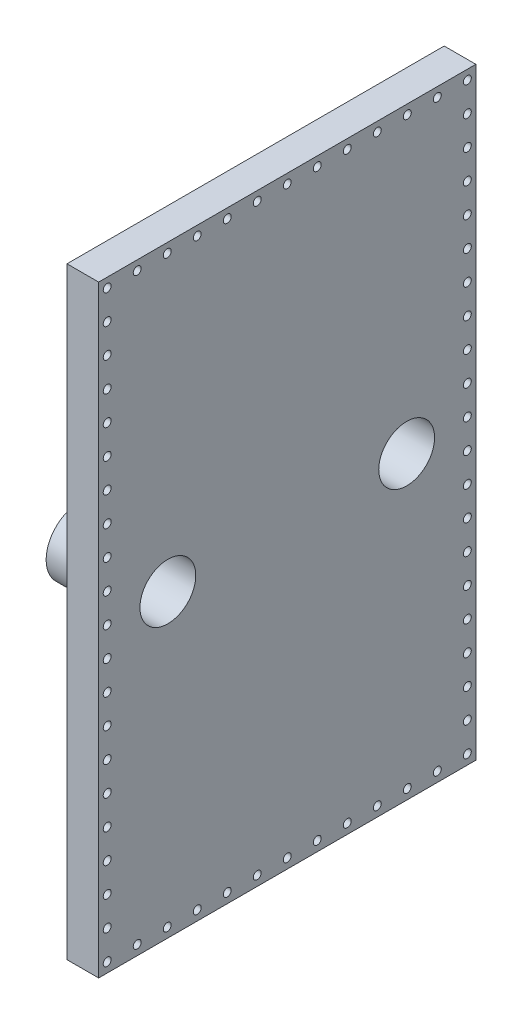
ISO-10303-21;
HEADER;
FILE_DESCRIPTION(('STEP AP214'),'2;1');
FILE_NAME('part.step','',(''),(''),'','','');
FILE_SCHEMA(('AUTOMOTIVE_DESIGN { 1 0 10303 214 1 1 1 1 }'));
ENDSEC;
DATA;
#1=APPLICATION_CONTEXT('core data for automotive mechanical design processes');
#2=APPLICATION_PROTOCOL_DEFINITION('international standard','automotive_design',2000,#1);
#3=PRODUCT_CONTEXT('',#1,'mechanical');
#4=PRODUCT('Part','Part','',(#3));
#5=PRODUCT_RELATED_PRODUCT_CATEGORY('part','',(#4));
#6=PRODUCT_DEFINITION_FORMATION('','',#4);
#7=PRODUCT_DEFINITION_CONTEXT('part definition',#1,'design');
#8=PRODUCT_DEFINITION('design','',#6,#7);
#9=PRODUCT_DEFINITION_SHAPE('','',#8);
#10=(LENGTH_UNIT() NAMED_UNIT(*) SI_UNIT(.MILLI.,.METRE.));
#11=(NAMED_UNIT(*) PLANE_ANGLE_UNIT() SI_UNIT($,.RADIAN.));
#12=(NAMED_UNIT(*) SI_UNIT($,.STERADIAN.) SOLID_ANGLE_UNIT());
#13=UNCERTAINTY_MEASURE_WITH_UNIT(LENGTH_MEASURE(1.E-05),#10,'distance_accuracy_value','');
#14=(GEOMETRIC_REPRESENTATION_CONTEXT(3) GLOBAL_UNCERTAINTY_ASSIGNED_CONTEXT((#13)) GLOBAL_UNIT_ASSIGNED_CONTEXT((#10,
#11,#12)) REPRESENTATION_CONTEXT('',''));
#15=CARTESIAN_POINT('',(0.,0.,0.));
#16=DIRECTION('',(0.,0.,1.));
#17=DIRECTION('',(1.,0.,0.));
#18=AXIS2_PLACEMENT_3D('',#15,#16,#17);
#19=CARTESIAN_POINT('',(38.,38.,452.5));
#20=DIRECTION('',(1.,0.,0.));
#21=DIRECTION('',(0.,0.,-1.));
#22=AXIS2_PLACEMENT_3D('',#19,#20,#21);
#23=PLANE('',#22);
#24=CARTESIAN_POINT('',(38.,360.,83.));
#25=DIRECTION('',(-1.,0.,0.));
#26=DIRECTION('',(0.,0.,1.));
#27=AXIS2_PLACEMENT_3D('',#24,#25,#26);
#28=CIRCLE('',#27,33.5);
#29=CARTESIAN_POINT('',(38.,360.,116.5));
#30=VERTEX_POINT('',#29);
#31=EDGE_CURVE('E379',#30,#30,#28,.T.);
#32=ORIENTED_EDGE('',*,*,#31,.T.);
#33=EDGE_LOOP('',(#32));
#34=FACE_BOUND('',#33,.T.);
#35=CARTESIAN_POINT('',(38.,360.,369.5));
#36=DIRECTION('',(-1.,0.,0.));
#37=DIRECTION('',(0.,0.,1.));
#38=AXIS2_PLACEMENT_3D('',#35,#36,#37);
#39=CIRCLE('',#38,33.5);
#40=CARTESIAN_POINT('',(38.,360.,403.));
#41=VERTEX_POINT('',#40);
#42=EDGE_CURVE('E371',#41,#41,#39,.T.);
#43=ORIENTED_EDGE('',*,*,#42,.T.);
#44=EDGE_LOOP('',(#43));
#45=FACE_BOUND('',#44,.T.);
#46=CARTESIAN_POINT('',(38.,711.75,10.25));
#47=DIRECTION('',(-1.,0.,0.));
#48=DIRECTION('',(0.,0.,1.));
#49=AXIS2_PLACEMENT_3D('',#46,#47,#48);
#50=CIRCLE('',#49,4.76250000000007);
#51=CARTESIAN_POINT('',(38.,711.75,15.0125000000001));
#52=VERTEX_POINT('',#51);
#53=EDGE_CURVE('E590',#52,#52,#50,.T.);
#54=ORIENTED_EDGE('',*,*,#53,.T.);
#55=EDGE_LOOP('',(#54));
#56=FACE_BOUND('',#55,.T.);
#57=CARTESIAN_POINT('',(38.,711.75,82.25));
#58=DIRECTION('',(-1.,0.,0.));
#59=DIRECTION('',(0.,0.,1.));
#60=AXIS2_PLACEMENT_3D('',#57,#58,#59);
#61=CIRCLE('',#60,4.76250000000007);
#62=CARTESIAN_POINT('',(38.,711.75,87.0125));
#63=VERTEX_POINT('',#62);
#64=EDGE_CURVE('E584',#63,#63,#61,.T.);
#65=ORIENTED_EDGE('',*,*,#64,.T.);
#66=EDGE_LOOP('',(#65));
#67=FACE_BOUND('',#66,.T.);
#68=CARTESIAN_POINT('',(38.,711.75,154.25));
#69=DIRECTION('',(-1.,0.,0.));
#70=DIRECTION('',(0.,0.,1.));
#71=AXIS2_PLACEMENT_3D('',#68,#69,#70);
#72=CIRCLE('',#71,4.7625000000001);
#73=CARTESIAN_POINT('',(38.,711.75,159.0125));
#74=VERTEX_POINT('',#73);
#75=EDGE_CURVE('E578',#74,#74,#72,.T.);
#76=ORIENTED_EDGE('',*,*,#75,.T.);
#77=EDGE_LOOP('',(#76));
#78=FACE_BOUND('',#77,.T.);
#79=CARTESIAN_POINT('',(38.,711.75,226.25));
#80=DIRECTION('',(-1.,0.,0.));
#81=DIRECTION('',(0.,0.,1.));
#82=AXIS2_PLACEMENT_3D('',#79,#80,#81);
#83=CIRCLE('',#82,4.7625000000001);
#84=CARTESIAN_POINT('',(38.,711.75,231.0125));
#85=VERTEX_POINT('',#84);
#86=EDGE_CURVE('E572',#85,#85,#83,.T.);
#87=ORIENTED_EDGE('',*,*,#86,.T.);
#88=EDGE_LOOP('',(#87));
#89=FACE_BOUND('',#88,.T.);
#90=CARTESIAN_POINT('',(38.,711.75,298.25));
#91=DIRECTION('',(-1.,0.,0.));
#92=DIRECTION('',(0.,0.,1.));
#93=AXIS2_PLACEMENT_3D('',#90,#91,#92);
#94=CIRCLE('',#93,4.76250000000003);
#95=CARTESIAN_POINT('',(38.,711.75,303.0125));
#96=VERTEX_POINT('',#95);
#97=EDGE_CURVE('E566',#96,#96,#94,.T.);
#98=ORIENTED_EDGE('',*,*,#97,.T.);
#99=EDGE_LOOP('',(#98));
#100=FACE_BOUND('',#99,.T.);
#101=CARTESIAN_POINT('',(38.,711.75,370.25));
#102=DIRECTION('',(-1.,0.,0.));
#103=DIRECTION('',(0.,0.,1.));
#104=AXIS2_PLACEMENT_3D('',#101,#102,#103);
#105=CIRCLE('',#104,4.76250000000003);
#106=CARTESIAN_POINT('',(38.,711.75,375.0125));
#107=VERTEX_POINT('',#106);
#108=EDGE_CURVE('E560',#107,#107,#105,.T.);
#109=ORIENTED_EDGE('',*,*,#108,.T.);
#110=EDGE_LOOP('',(#109));
#111=FACE_BOUND('',#110,.T.);
#112=CARTESIAN_POINT('',(38.,711.75,442.25));
#113=DIRECTION('',(-1.,0.,0.));
#114=DIRECTION('',(0.,0.,1.));
#115=AXIS2_PLACEMENT_3D('',#112,#113,#114);
#116=CIRCLE('',#115,4.76250000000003);
#117=CARTESIAN_POINT('',(38.,711.75,447.0125));
#118=VERTEX_POINT('',#117);
#119=EDGE_CURVE('E554',#118,#118,#116,.T.);
#120=ORIENTED_EDGE('',*,*,#119,.T.);
#121=EDGE_LOOP('',(#120));
#122=FACE_BOUND('',#121,.T.);
#123=CARTESIAN_POINT('',(38.,641.75,10.2500000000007));
#124=DIRECTION('',(-1.,0.,0.));
#125=DIRECTION('',(0.,0.,1.));
#126=AXIS2_PLACEMENT_3D('',#123,#124,#125);
#127=CIRCLE('',#126,4.7625000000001);
#128=CARTESIAN_POINT('',(38.,641.75,15.0125000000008));
#129=VERTEX_POINT('',#128);
#130=EDGE_CURVE('E548',#129,#129,#127,.T.);
#131=ORIENTED_EDGE('',*,*,#130,.T.);
#132=EDGE_LOOP('',(#131));
#133=FACE_BOUND('',#132,.T.);
#134=CARTESIAN_POINT('',(38.,571.75,10.2500000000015));
#135=DIRECTION('',(-1.,0.,0.));
#136=DIRECTION('',(0.,0.,1.));
#137=AXIS2_PLACEMENT_3D('',#134,#135,#136);
#138=CIRCLE('',#137,4.7625000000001);
#139=CARTESIAN_POINT('',(38.,571.75,15.0125000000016));
#140=VERTEX_POINT('',#139);
#141=EDGE_CURVE('E542',#140,#140,#138,.T.);
#142=ORIENTED_EDGE('',*,*,#141,.T.);
#143=EDGE_LOOP('',(#142));
#144=FACE_BOUND('',#143,.T.);
#145=CARTESIAN_POINT('',(38.,501.75,10.2500000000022));
#146=DIRECTION('',(-1.,0.,0.));
#147=DIRECTION('',(0.,0.,1.));
#148=AXIS2_PLACEMENT_3D('',#145,#146,#147);
#149=CIRCLE('',#148,4.76250000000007);
#150=CARTESIAN_POINT('',(38.,501.75,15.0125000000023));
#151=VERTEX_POINT('',#150);
#152=EDGE_CURVE('E536',#151,#151,#149,.T.);
#153=ORIENTED_EDGE('',*,*,#152,.T.);
#154=EDGE_LOOP('',(#153));
#155=FACE_BOUND('',#154,.T.);
#156=CARTESIAN_POINT('',(38.,431.750000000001,10.2500000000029));
#157=DIRECTION('',(-1.,0.,0.));
#158=DIRECTION('',(0.,0.,1.));
#159=AXIS2_PLACEMENT_3D('',#156,#157,#158);
#160=CIRCLE('',#159,4.76250000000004);
#161=CARTESIAN_POINT('',(38.,431.750000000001,15.012500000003));
#162=VERTEX_POINT('',#161);
#163=EDGE_CURVE('E530',#162,#162,#160,.T.);
#164=ORIENTED_EDGE('',*,*,#163,.T.);
#165=EDGE_LOOP('',(#164));
#166=FACE_BOUND('',#165,.T.);
#167=CARTESIAN_POINT('',(38.,361.750000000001,10.2500000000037));
#168=DIRECTION('',(-1.,0.,0.));
#169=DIRECTION('',(0.,0.,1.));
#170=AXIS2_PLACEMENT_3D('',#167,#168,#169);
#171=CIRCLE('',#170,4.76250000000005);
#172=CARTESIAN_POINT('',(38.,361.750000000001,15.0125000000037));
#173=VERTEX_POINT('',#172);
#174=EDGE_CURVE('E524',#173,#173,#171,.T.);
#175=ORIENTED_EDGE('',*,*,#174,.T.);
#176=EDGE_LOOP('',(#175));
#177=FACE_BOUND('',#176,.T.);
#178=CARTESIAN_POINT('',(38.,291.750000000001,10.2500000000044));
#179=DIRECTION('',(-1.,0.,0.));
#180=DIRECTION('',(0.,0.,1.));
#181=AXIS2_PLACEMENT_3D('',#178,#179,#180);
#182=CIRCLE('',#181,4.76250000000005);
#183=CARTESIAN_POINT('',(38.,291.750000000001,15.0125000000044));
#184=VERTEX_POINT('',#183);
#185=EDGE_CURVE('E518',#184,#184,#182,.T.);
#186=ORIENTED_EDGE('',*,*,#185,.T.);
#187=EDGE_LOOP('',(#186));
#188=FACE_BOUND('',#187,.T.);
#189=CARTESIAN_POINT('',(38.,221.750000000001,10.2500000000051));
#190=DIRECTION('',(-1.,0.,0.));
#191=DIRECTION('',(0.,0.,1.));
#192=AXIS2_PLACEMENT_3D('',#189,#190,#191);
#193=CIRCLE('',#192,4.76250000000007);
#194=CARTESIAN_POINT('',(38.,221.750000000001,15.0125000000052));
#195=VERTEX_POINT('',#194);
#196=EDGE_CURVE('E512',#195,#195,#193,.T.);
#197=ORIENTED_EDGE('',*,*,#196,.T.);
#198=EDGE_LOOP('',(#197));
#199=FACE_BOUND('',#198,.T.);
#200=CARTESIAN_POINT('',(38.,151.750000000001,10.2500000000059));
#201=DIRECTION('',(-1.,0.,0.));
#202=DIRECTION('',(0.,0.,1.));
#203=AXIS2_PLACEMENT_3D('',#200,#201,#202);
#204=CIRCLE('',#203,4.76250000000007);
#205=CARTESIAN_POINT('',(38.,151.750000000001,15.0125000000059));
#206=VERTEX_POINT('',#205);
#207=EDGE_CURVE('E506',#206,#206,#204,.T.);
#208=ORIENTED_EDGE('',*,*,#207,.T.);
#209=EDGE_LOOP('',(#208));
#210=FACE_BOUND('',#209,.T.);
#211=CARTESIAN_POINT('',(38.,81.7500000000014,10.2500000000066));
#212=DIRECTION('',(-1.,0.,0.));
#213=DIRECTION('',(0.,0.,1.));
#214=AXIS2_PLACEMENT_3D('',#211,#212,#213);
#215=CIRCLE('',#214,4.76250000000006);
#216=CARTESIAN_POINT('',(38.,81.7500000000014,15.0125000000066));
#217=VERTEX_POINT('',#216);
#218=EDGE_CURVE('E500',#217,#217,#215,.T.);
#219=ORIENTED_EDGE('',*,*,#218,.T.);
#220=EDGE_LOOP('',(#219));
#221=FACE_BOUND('',#220,.T.);
#222=CARTESIAN_POINT('',(38.,11.7500000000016,10.2500000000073));
#223=DIRECTION('',(-1.,0.,0.));
#224=DIRECTION('',(0.,0.,1.));
#225=AXIS2_PLACEMENT_3D('',#222,#223,#224);
#226=CIRCLE('',#225,4.76250000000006);
#227=CARTESIAN_POINT('',(38.,11.7500000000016,15.0125000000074));
#228=VERTEX_POINT('',#227);
#229=EDGE_CURVE('E494',#228,#228,#226,.T.);
#230=ORIENTED_EDGE('',*,*,#229,.T.);
#231=EDGE_LOOP('',(#230));
#232=FACE_BOUND('',#231,.T.);
#233=CARTESIAN_POINT('',(38.,11.7500000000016,82.2500000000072));
#234=DIRECTION('',(-1.,0.,0.));
#235=DIRECTION('',(0.,0.,1.));
#236=AXIS2_PLACEMENT_3D('',#233,#234,#235);
#237=CIRCLE('',#236,4.76250000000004);
#238=CARTESIAN_POINT('',(38.,11.7500000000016,87.0125000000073));
#239=VERTEX_POINT('',#238);
#240=EDGE_CURVE('E488',#239,#239,#237,.T.);
#241=ORIENTED_EDGE('',*,*,#240,.T.);
#242=EDGE_LOOP('',(#241));
#243=FACE_BOUND('',#242,.T.);
#244=CARTESIAN_POINT('',(38.,11.7500000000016,154.250000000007));
#245=DIRECTION('',(-1.,0.,0.));
#246=DIRECTION('',(0.,0.,1.));
#247=AXIS2_PLACEMENT_3D('',#244,#245,#246);
#248=CIRCLE('',#247,4.76250000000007);
#249=CARTESIAN_POINT('',(38.,11.7500000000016,159.012500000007));
#250=VERTEX_POINT('',#249);
#251=EDGE_CURVE('E482',#250,#250,#248,.T.);
#252=ORIENTED_EDGE('',*,*,#251,.T.);
#253=EDGE_LOOP('',(#252));
#254=FACE_BOUND('',#253,.T.);
#255=CARTESIAN_POINT('',(38.,11.7500000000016,226.250000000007));
#256=DIRECTION('',(-1.,0.,0.));
#257=DIRECTION('',(0.,0.,1.));
#258=AXIS2_PLACEMENT_3D('',#255,#256,#257);
#259=CIRCLE('',#258,4.76250000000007);
#260=CARTESIAN_POINT('',(38.,11.7500000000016,231.012500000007));
#261=VERTEX_POINT('',#260);
#262=EDGE_CURVE('E476',#261,#261,#259,.T.);
#263=ORIENTED_EDGE('',*,*,#262,.T.);
#264=EDGE_LOOP('',(#263));
#265=FACE_BOUND('',#264,.T.);
#266=CARTESIAN_POINT('',(38.,11.7500000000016,298.250000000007));
#267=DIRECTION('',(-1.,0.,0.));
#268=DIRECTION('',(0.,0.,1.));
#269=AXIS2_PLACEMENT_3D('',#266,#267,#268);
#270=CIRCLE('',#269,4.76250000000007);
#271=CARTESIAN_POINT('',(38.,11.7500000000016,303.012500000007));
#272=VERTEX_POINT('',#271);
#273=EDGE_CURVE('E470',#272,#272,#270,.T.);
#274=ORIENTED_EDGE('',*,*,#273,.T.);
#275=EDGE_LOOP('',(#274));
#276=FACE_BOUND('',#275,.T.);
#277=CARTESIAN_POINT('',(38.,11.7500000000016,370.250000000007));
#278=DIRECTION('',(-1.,0.,0.));
#279=DIRECTION('',(0.,0.,1.));
#280=AXIS2_PLACEMENT_3D('',#277,#278,#279);
#281=CIRCLE('',#280,4.76250000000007);
#282=CARTESIAN_POINT('',(38.,11.7500000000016,375.012500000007));
#283=VERTEX_POINT('',#282);
#284=EDGE_CURVE('E464',#283,#283,#281,.T.);
#285=ORIENTED_EDGE('',*,*,#284,.T.);
#286=EDGE_LOOP('',(#285));
#287=FACE_BOUND('',#286,.T.);
#288=CARTESIAN_POINT('',(38.,11.7500000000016,442.250000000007));
#289=DIRECTION('',(-1.,0.,0.));
#290=DIRECTION('',(0.,0.,1.));
#291=AXIS2_PLACEMENT_3D('',#288,#289,#290);
#292=CIRCLE('',#291,4.76250000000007);
#293=CARTESIAN_POINT('',(38.,11.7500000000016,447.012500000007));
#294=VERTEX_POINT('',#293);
#295=EDGE_CURVE('E458',#294,#294,#292,.T.);
#296=ORIENTED_EDGE('',*,*,#295,.T.);
#297=EDGE_LOOP('',(#296));
#298=FACE_BOUND('',#297,.T.);
#299=CARTESIAN_POINT('',(38.,81.7500000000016,442.250000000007));
#300=DIRECTION('',(-1.,0.,0.));
#301=DIRECTION('',(0.,0.,1.));
#302=AXIS2_PLACEMENT_3D('',#299,#300,#301);
#303=CIRCLE('',#302,4.76250000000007);
#304=CARTESIAN_POINT('',(38.,81.7500000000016,447.012500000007));
#305=VERTEX_POINT('',#304);
#306=EDGE_CURVE('E452',#305,#305,#303,.T.);
#307=ORIENTED_EDGE('',*,*,#306,.T.);
#308=EDGE_LOOP('',(#307));
#309=FACE_BOUND('',#308,.T.);
#310=CARTESIAN_POINT('',(38.,151.750000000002,442.250000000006));
#311=DIRECTION('',(-1.,0.,0.));
#312=DIRECTION('',(0.,0.,1.));
#313=AXIS2_PLACEMENT_3D('',#310,#311,#312);
#314=CIRCLE('',#313,4.76250000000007);
#315=CARTESIAN_POINT('',(38.,151.750000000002,447.012500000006));
#316=VERTEX_POINT('',#315);
#317=EDGE_CURVE('E446',#316,#316,#314,.T.);
#318=ORIENTED_EDGE('',*,*,#317,.T.);
#319=EDGE_LOOP('',(#318));
#320=FACE_BOUND('',#319,.T.);
#321=CARTESIAN_POINT('',(38.,221.750000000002,442.250000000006));
#322=DIRECTION('',(-1.,0.,0.));
#323=DIRECTION('',(0.,0.,1.));
#324=AXIS2_PLACEMENT_3D('',#321,#322,#323);
#325=CIRCLE('',#324,4.76250000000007);
#326=CARTESIAN_POINT('',(38.,221.750000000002,447.012500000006));
#327=VERTEX_POINT('',#326);
#328=EDGE_CURVE('E440',#327,#327,#325,.T.);
#329=ORIENTED_EDGE('',*,*,#328,.T.);
#330=EDGE_LOOP('',(#329));
#331=FACE_BOUND('',#330,.T.);
#332=CARTESIAN_POINT('',(38.,291.750000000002,442.250000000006));
#333=DIRECTION('',(-1.,0.,0.));
#334=DIRECTION('',(0.,0.,1.));
#335=AXIS2_PLACEMENT_3D('',#332,#333,#334);
#336=CIRCLE('',#335,4.76250000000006);
#337=CARTESIAN_POINT('',(38.,291.750000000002,447.012500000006));
#338=VERTEX_POINT('',#337);
#339=EDGE_CURVE('E434',#338,#338,#336,.T.);
#340=ORIENTED_EDGE('',*,*,#339,.T.);
#341=EDGE_LOOP('',(#340));
#342=FACE_BOUND('',#341,.T.);
#343=CARTESIAN_POINT('',(38.,361.750000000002,442.250000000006));
#344=DIRECTION('',(-1.,0.,0.));
#345=DIRECTION('',(0.,0.,1.));
#346=AXIS2_PLACEMENT_3D('',#343,#344,#345);
#347=CIRCLE('',#346,4.76250000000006);
#348=CARTESIAN_POINT('',(38.,361.750000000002,447.012500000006));
#349=VERTEX_POINT('',#348);
#350=EDGE_CURVE('E428',#349,#349,#347,.T.);
#351=ORIENTED_EDGE('',*,*,#350,.T.);
#352=EDGE_LOOP('',(#351));
#353=FACE_BOUND('',#352,.T.);
#354=CARTESIAN_POINT('',(38.,431.750000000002,442.250000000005));
#355=DIRECTION('',(-1.,0.,0.));
#356=DIRECTION('',(0.,0.,1.));
#357=AXIS2_PLACEMENT_3D('',#354,#355,#356);
#358=CIRCLE('',#357,4.76250000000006);
#359=CARTESIAN_POINT('',(38.,431.750000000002,447.012500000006));
#360=VERTEX_POINT('',#359);
#361=EDGE_CURVE('E422',#360,#360,#358,.T.);
#362=ORIENTED_EDGE('',*,*,#361,.T.);
#363=EDGE_LOOP('',(#362));
#364=FACE_BOUND('',#363,.T.);
#365=CARTESIAN_POINT('',(38.,501.750000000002,442.250000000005));
#366=DIRECTION('',(-1.,0.,0.));
#367=DIRECTION('',(0.,0.,1.));
#368=AXIS2_PLACEMENT_3D('',#365,#366,#367);
#369=CIRCLE('',#368,4.76250000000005);
#370=CARTESIAN_POINT('',(38.,501.750000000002,447.012500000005));
#371=VERTEX_POINT('',#370);
#372=EDGE_CURVE('E416',#371,#371,#369,.T.);
#373=ORIENTED_EDGE('',*,*,#372,.T.);
#374=EDGE_LOOP('',(#373));
#375=FACE_BOUND('',#374,.T.);
#376=CARTESIAN_POINT('',(38.,571.750000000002,442.250000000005));
#377=DIRECTION('',(-1.,0.,0.));
#378=DIRECTION('',(0.,0.,1.));
#379=AXIS2_PLACEMENT_3D('',#376,#377,#378);
#380=CIRCLE('',#379,4.76250000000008);
#381=CARTESIAN_POINT('',(38.,571.750000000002,447.012500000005));
#382=VERTEX_POINT('',#381);
#383=EDGE_CURVE('E410',#382,#382,#380,.T.);
#384=ORIENTED_EDGE('',*,*,#383,.T.);
#385=EDGE_LOOP('',(#384));
#386=FACE_BOUND('',#385,.T.);
#387=CARTESIAN_POINT('',(38.,641.750000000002,442.250000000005));
#388=DIRECTION('',(-1.,0.,0.));
#389=DIRECTION('',(0.,0.,1.));
#390=AXIS2_PLACEMENT_3D('',#387,#388,#389);
#391=CIRCLE('',#390,4.76250000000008);
#392=CARTESIAN_POINT('',(38.,641.750000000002,447.012500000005));
#393=VERTEX_POINT('',#392);
#394=EDGE_CURVE('E404',#393,#393,#391,.T.);
#395=ORIENTED_EDGE('',*,*,#394,.T.);
#396=EDGE_LOOP('',(#395));
#397=FACE_BOUND('',#396,.T.);
#398=DIRECTION('',(0.,0.,1.));
#399=VECTOR('',#398,1.);
#400=CARTESIAN_POINT('',(38.,723.,-0.000999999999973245));
#401=LINE('',#400,#399);
#402=CARTESIAN_POINT('',(38.,723.,0.));
#403=VERTEX_POINT('',#402);
#404=CARTESIAN_POINT('',(38.,723.,452.5));
#405=VERTEX_POINT('',#404);
#406=EDGE_CURVE('E72',#403,#405,#401,.T.);
#407=ORIENTED_EDGE('',*,*,#406,.T.);
#408=DIRECTION('',(0.,-1.,0.));
#409=VECTOR('',#408,1.);
#410=CARTESIAN_POINT('',(38.,723.,452.5));
#411=LINE('',#410,#409);
#412=CARTESIAN_POINT('',(38.,0.,452.5));
#413=VERTEX_POINT('',#412);
#414=EDGE_CURVE('E390',#405,#413,#411,.T.);
#415=ORIENTED_EDGE('',*,*,#414,.T.);
#416=DIRECTION('',(0.,0.,1.));
#417=VECTOR('',#416,1.);
#418=CARTESIAN_POINT('',(38.,0.,-0.000999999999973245));
#419=LINE('',#418,#417);
#420=CARTESIAN_POINT('',(38.,0.,0.));
#421=VERTEX_POINT('',#420);
#422=EDGE_CURVE('E396',#421,#413,#419,.T.);
#423=ORIENTED_EDGE('',*,*,#422,.F.);
#424=DIRECTION('',(0.,-1.,0.));
#425=VECTOR('',#424,1.);
#426=CARTESIAN_POINT('',(38.,723.,0.));
#427=LINE('',#426,#425);
#428=EDGE_CURVE('E45',#403,#421,#427,.T.);
#429=ORIENTED_EDGE('',*,*,#428,.F.);
#430=EDGE_LOOP('',(#407,#415,#423,#429));
#431=FACE_BOUND('',#430,.T.);
#432=CARTESIAN_POINT('',(38.,676.750000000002,442.250000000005));
#433=DIRECTION('',(-1.,0.,0.));
#434=DIRECTION('',(0.,0.,1.));
#435=AXIS2_PLACEMENT_3D('',#432,#433,#434);
#436=CIRCLE('',#435,4.76250000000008);
#437=CARTESIAN_POINT('',(38.,676.750000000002,447.012500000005));
#438=VERTEX_POINT('',#437);
#439=EDGE_CURVE('E398',#438,#438,#436,.T.);
#440=ORIENTED_EDGE('',*,*,#439,.T.);
#441=EDGE_LOOP('',(#440));
#442=FACE_BOUND('',#441,.T.);
#443=CARTESIAN_POINT('',(38.,606.750000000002,442.250000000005));
#444=DIRECTION('',(-1.,0.,0.));
#445=DIRECTION('',(0.,0.,1.));
#446=AXIS2_PLACEMENT_3D('',#443,#444,#445);
#447=CIRCLE('',#446,4.76250000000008);
#448=CARTESIAN_POINT('',(38.,606.750000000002,447.012500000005));
#449=VERTEX_POINT('',#448);
#450=EDGE_CURVE('E407',#449,#449,#447,.T.);
#451=ORIENTED_EDGE('',*,*,#450,.T.);
#452=EDGE_LOOP('',(#451));
#453=FACE_BOUND('',#452,.T.);
#454=CARTESIAN_POINT('',(38.,536.750000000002,442.250000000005));
#455=DIRECTION('',(-1.,0.,0.));
#456=DIRECTION('',(0.,0.,1.));
#457=AXIS2_PLACEMENT_3D('',#454,#455,#456);
#458=CIRCLE('',#457,4.76250000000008);
#459=CARTESIAN_POINT('',(38.,536.750000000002,447.012500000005));
#460=VERTEX_POINT('',#459);
#461=EDGE_CURVE('E413',#460,#460,#458,.T.);
#462=ORIENTED_EDGE('',*,*,#461,.T.);
#463=EDGE_LOOP('',(#462));
#464=FACE_BOUND('',#463,.T.);
#465=CARTESIAN_POINT('',(38.,466.750000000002,442.250000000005));
#466=DIRECTION('',(-1.,0.,0.));
#467=DIRECTION('',(0.,0.,1.));
#468=AXIS2_PLACEMENT_3D('',#465,#466,#467);
#469=CIRCLE('',#468,4.76250000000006);
#470=CARTESIAN_POINT('',(38.,466.750000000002,447.012500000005));
#471=VERTEX_POINT('',#470);
#472=EDGE_CURVE('E419',#471,#471,#469,.T.);
#473=ORIENTED_EDGE('',*,*,#472,.T.);
#474=EDGE_LOOP('',(#473));
#475=FACE_BOUND('',#474,.T.);
#476=CARTESIAN_POINT('',(38.,396.750000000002,442.250000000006));
#477=DIRECTION('',(-1.,0.,0.));
#478=DIRECTION('',(0.,0.,1.));
#479=AXIS2_PLACEMENT_3D('',#476,#477,#478);
#480=CIRCLE('',#479,4.76250000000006);
#481=CARTESIAN_POINT('',(38.,396.750000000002,447.012500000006));
#482=VERTEX_POINT('',#481);
#483=EDGE_CURVE('E425',#482,#482,#480,.T.);
#484=ORIENTED_EDGE('',*,*,#483,.T.);
#485=EDGE_LOOP('',(#484));
#486=FACE_BOUND('',#485,.T.);
#487=CARTESIAN_POINT('',(38.,326.750000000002,442.250000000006));
#488=DIRECTION('',(-1.,0.,0.));
#489=DIRECTION('',(0.,0.,1.));
#490=AXIS2_PLACEMENT_3D('',#487,#488,#489);
#491=CIRCLE('',#490,4.76250000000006);
#492=CARTESIAN_POINT('',(38.,326.750000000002,447.012500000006));
#493=VERTEX_POINT('',#492);
#494=EDGE_CURVE('E431',#493,#493,#491,.T.);
#495=ORIENTED_EDGE('',*,*,#494,.T.);
#496=EDGE_LOOP('',(#495));
#497=FACE_BOUND('',#496,.T.);
#498=CARTESIAN_POINT('',(38.,256.750000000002,442.250000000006));
#499=DIRECTION('',(-1.,0.,0.));
#500=DIRECTION('',(0.,0.,1.));
#501=AXIS2_PLACEMENT_3D('',#498,#499,#500);
#502=CIRCLE('',#501,4.76250000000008);
#503=CARTESIAN_POINT('',(38.,256.750000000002,447.012500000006));
#504=VERTEX_POINT('',#503);
#505=EDGE_CURVE('E437',#504,#504,#502,.T.);
#506=ORIENTED_EDGE('',*,*,#505,.T.);
#507=EDGE_LOOP('',(#506));
#508=FACE_BOUND('',#507,.T.);
#509=CARTESIAN_POINT('',(38.,186.750000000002,442.250000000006));
#510=DIRECTION('',(-1.,0.,0.));
#511=DIRECTION('',(0.,0.,1.));
#512=AXIS2_PLACEMENT_3D('',#509,#510,#511);
#513=CIRCLE('',#512,4.76250000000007);
#514=CARTESIAN_POINT('',(38.,186.750000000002,447.012500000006));
#515=VERTEX_POINT('',#514);
#516=EDGE_CURVE('E443',#515,#515,#513,.T.);
#517=ORIENTED_EDGE('',*,*,#516,.T.);
#518=EDGE_LOOP('',(#517));
#519=FACE_BOUND('',#518,.T.);
#520=CARTESIAN_POINT('',(38.,116.750000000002,442.250000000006));
#521=DIRECTION('',(-1.,0.,0.));
#522=DIRECTION('',(0.,0.,1.));
#523=AXIS2_PLACEMENT_3D('',#520,#521,#522);
#524=CIRCLE('',#523,4.76250000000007);
#525=CARTESIAN_POINT('',(38.,116.750000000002,447.012500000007));
#526=VERTEX_POINT('',#525);
#527=EDGE_CURVE('E449',#526,#526,#524,.T.);
#528=ORIENTED_EDGE('',*,*,#527,.T.);
#529=EDGE_LOOP('',(#528));
#530=FACE_BOUND('',#529,.T.);
#531=CARTESIAN_POINT('',(38.,46.7500000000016,442.250000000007));
#532=DIRECTION('',(-1.,0.,0.));
#533=DIRECTION('',(0.,0.,1.));
#534=AXIS2_PLACEMENT_3D('',#531,#532,#533);
#535=CIRCLE('',#534,4.76250000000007);
#536=CARTESIAN_POINT('',(38.,46.7500000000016,447.012500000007));
#537=VERTEX_POINT('',#536);
#538=EDGE_CURVE('E455',#537,#537,#535,.T.);
#539=ORIENTED_EDGE('',*,*,#538,.T.);
#540=EDGE_LOOP('',(#539));
#541=FACE_BOUND('',#540,.T.);
#542=CARTESIAN_POINT('',(38.,11.7500000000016,406.250000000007));
#543=DIRECTION('',(-1.,0.,0.));
#544=DIRECTION('',(0.,0.,1.));
#545=AXIS2_PLACEMENT_3D('',#542,#543,#544);
#546=CIRCLE('',#545,4.76250000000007);
#547=CARTESIAN_POINT('',(38.,11.7500000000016,411.012500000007));
#548=VERTEX_POINT('',#547);
#549=EDGE_CURVE('E461',#548,#548,#546,.T.);
#550=ORIENTED_EDGE('',*,*,#549,.T.);
#551=EDGE_LOOP('',(#550));
#552=FACE_BOUND('',#551,.T.);
#553=CARTESIAN_POINT('',(38.,11.7500000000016,334.250000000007));
#554=DIRECTION('',(-1.,0.,0.));
#555=DIRECTION('',(0.,0.,1.));
#556=AXIS2_PLACEMENT_3D('',#553,#554,#555);
#557=CIRCLE('',#556,4.76250000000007);
#558=CARTESIAN_POINT('',(38.,11.7500000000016,339.012500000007));
#559=VERTEX_POINT('',#558);
#560=EDGE_CURVE('E467',#559,#559,#557,.T.);
#561=ORIENTED_EDGE('',*,*,#560,.T.);
#562=EDGE_LOOP('',(#561));
#563=FACE_BOUND('',#562,.T.);
#564=CARTESIAN_POINT('',(38.,11.7500000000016,262.250000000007));
#565=DIRECTION('',(-1.,0.,0.));
#566=DIRECTION('',(0.,0.,1.));
#567=AXIS2_PLACEMENT_3D('',#564,#565,#566);
#568=CIRCLE('',#567,4.76250000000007);
#569=CARTESIAN_POINT('',(38.,11.7500000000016,267.012500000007));
#570=VERTEX_POINT('',#569);
#571=EDGE_CURVE('E473',#570,#570,#568,.T.);
#572=ORIENTED_EDGE('',*,*,#571,.T.);
#573=EDGE_LOOP('',(#572));
#574=FACE_BOUND('',#573,.T.);
#575=CARTESIAN_POINT('',(38.,11.7500000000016,190.250000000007));
#576=DIRECTION('',(-1.,0.,0.));
#577=DIRECTION('',(0.,0.,1.));
#578=AXIS2_PLACEMENT_3D('',#575,#576,#577);
#579=CIRCLE('',#578,4.76250000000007);
#580=CARTESIAN_POINT('',(38.,11.7500000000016,195.012500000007));
#581=VERTEX_POINT('',#580);
#582=EDGE_CURVE('E479',#581,#581,#579,.T.);
#583=ORIENTED_EDGE('',*,*,#582,.T.);
#584=EDGE_LOOP('',(#583));
#585=FACE_BOUND('',#584,.T.);
#586=CARTESIAN_POINT('',(38.,11.7500000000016,118.250000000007));
#587=DIRECTION('',(-1.,0.,0.));
#588=DIRECTION('',(0.,0.,1.));
#589=AXIS2_PLACEMENT_3D('',#586,#587,#588);
#590=CIRCLE('',#589,4.76250000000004);
#591=CARTESIAN_POINT('',(38.,11.7500000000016,123.012500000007));
#592=VERTEX_POINT('',#591);
#593=EDGE_CURVE('E485',#592,#592,#590,.T.);
#594=ORIENTED_EDGE('',*,*,#593,.T.);
#595=EDGE_LOOP('',(#594));
#596=FACE_BOUND('',#595,.T.);
#597=CARTESIAN_POINT('',(38.,11.7500000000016,46.2500000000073));
#598=DIRECTION('',(-1.,0.,0.));
#599=DIRECTION('',(0.,0.,1.));
#600=AXIS2_PLACEMENT_3D('',#597,#598,#599);
#601=CIRCLE('',#600,4.76250000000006);
#602=CARTESIAN_POINT('',(38.,11.7500000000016,51.0125000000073));
#603=VERTEX_POINT('',#602);
#604=EDGE_CURVE('E491',#603,#603,#601,.T.);
#605=ORIENTED_EDGE('',*,*,#604,.T.);
#606=EDGE_LOOP('',(#605));
#607=FACE_BOUND('',#606,.T.);
#608=CARTESIAN_POINT('',(38.,46.7500000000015,10.250000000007));
#609=DIRECTION('',(-1.,0.,0.));
#610=DIRECTION('',(0.,0.,1.));
#611=AXIS2_PLACEMENT_3D('',#608,#609,#610);
#612=CIRCLE('',#611,4.76250000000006);
#613=CARTESIAN_POINT('',(38.,46.7500000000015,15.012500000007));
#614=VERTEX_POINT('',#613);
#615=EDGE_CURVE('E497',#614,#614,#612,.T.);
#616=ORIENTED_EDGE('',*,*,#615,.T.);
#617=EDGE_LOOP('',(#616));
#618=FACE_BOUND('',#617,.T.);
#619=CARTESIAN_POINT('',(38.,116.750000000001,10.2500000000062));
#620=DIRECTION('',(-1.,0.,0.));
#621=DIRECTION('',(0.,0.,1.));
#622=AXIS2_PLACEMENT_3D('',#619,#620,#621);
#623=CIRCLE('',#622,4.76250000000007);
#624=CARTESIAN_POINT('',(38.,116.750000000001,15.0125000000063));
#625=VERTEX_POINT('',#624);
#626=EDGE_CURVE('E503',#625,#625,#623,.T.);
#627=ORIENTED_EDGE('',*,*,#626,.T.);
#628=EDGE_LOOP('',(#627));
#629=FACE_BOUND('',#628,.T.);
#630=CARTESIAN_POINT('',(38.,186.750000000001,10.2500000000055));
#631=DIRECTION('',(-1.,0.,0.));
#632=DIRECTION('',(0.,0.,1.));
#633=AXIS2_PLACEMENT_3D('',#630,#631,#632);
#634=CIRCLE('',#633,4.76250000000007);
#635=CARTESIAN_POINT('',(38.,186.750000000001,15.0125000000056));
#636=VERTEX_POINT('',#635);
#637=EDGE_CURVE('E509',#636,#636,#634,.T.);
#638=ORIENTED_EDGE('',*,*,#637,.T.);
#639=EDGE_LOOP('',(#638));
#640=FACE_BOUND('',#639,.T.);
#641=CARTESIAN_POINT('',(38.,256.750000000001,10.2500000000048));
#642=DIRECTION('',(-1.,0.,0.));
#643=DIRECTION('',(0.,0.,1.));
#644=AXIS2_PLACEMENT_3D('',#641,#642,#643);
#645=CIRCLE('',#644,4.76250000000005);
#646=CARTESIAN_POINT('',(38.,256.750000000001,15.0125000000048));
#647=VERTEX_POINT('',#646);
#648=EDGE_CURVE('E515',#647,#647,#645,.T.);
#649=ORIENTED_EDGE('',*,*,#648,.T.);
#650=EDGE_LOOP('',(#649));
#651=FACE_BOUND('',#650,.T.);
#652=CARTESIAN_POINT('',(38.,326.750000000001,10.250000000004));
#653=DIRECTION('',(-1.,0.,0.));
#654=DIRECTION('',(0.,0.,1.));
#655=AXIS2_PLACEMENT_3D('',#652,#653,#654);
#656=CIRCLE('',#655,4.76250000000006);
#657=CARTESIAN_POINT('',(38.,326.750000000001,15.0125000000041));
#658=VERTEX_POINT('',#657);
#659=EDGE_CURVE('E521',#658,#658,#656,.T.);
#660=ORIENTED_EDGE('',*,*,#659,.T.);
#661=EDGE_LOOP('',(#660));
#662=FACE_BOUND('',#661,.T.);
#663=CARTESIAN_POINT('',(38.,396.750000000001,10.2500000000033));
#664=DIRECTION('',(-1.,0.,0.));
#665=DIRECTION('',(0.,0.,1.));
#666=AXIS2_PLACEMENT_3D('',#663,#664,#665);
#667=CIRCLE('',#666,4.76250000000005);
#668=CARTESIAN_POINT('',(38.,396.750000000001,15.0125000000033));
#669=VERTEX_POINT('',#668);
#670=EDGE_CURVE('E527',#669,#669,#667,.T.);
#671=ORIENTED_EDGE('',*,*,#670,.T.);
#672=EDGE_LOOP('',(#671));
#673=FACE_BOUND('',#672,.T.);
#674=CARTESIAN_POINT('',(38.,466.750000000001,10.2500000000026));
#675=DIRECTION('',(-1.,0.,0.));
#676=DIRECTION('',(0.,0.,1.));
#677=AXIS2_PLACEMENT_3D('',#674,#675,#676);
#678=CIRCLE('',#677,4.76250000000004);
#679=CARTESIAN_POINT('',(38.,466.750000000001,15.0125000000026));
#680=VERTEX_POINT('',#679);
#681=EDGE_CURVE('E533',#680,#680,#678,.T.);
#682=ORIENTED_EDGE('',*,*,#681,.T.);
#683=EDGE_LOOP('',(#682));
#684=FACE_BOUND('',#683,.T.);
#685=CARTESIAN_POINT('',(38.,536.75,10.2500000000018));
#686=DIRECTION('',(-1.,0.,0.));
#687=DIRECTION('',(0.,0.,1.));
#688=AXIS2_PLACEMENT_3D('',#685,#686,#687);
#689=CIRCLE('',#688,4.76250000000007);
#690=CARTESIAN_POINT('',(38.,536.75,15.0125000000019));
#691=VERTEX_POINT('',#690);
#692=EDGE_CURVE('E539',#691,#691,#689,.T.);
#693=ORIENTED_EDGE('',*,*,#692,.T.);
#694=EDGE_LOOP('',(#693));
#695=FACE_BOUND('',#694,.T.);
#696=CARTESIAN_POINT('',(38.,606.75,10.2500000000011));
#697=DIRECTION('',(-1.,0.,0.));
#698=DIRECTION('',(0.,0.,1.));
#699=AXIS2_PLACEMENT_3D('',#696,#697,#698);
#700=CIRCLE('',#699,4.7625000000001);
#701=CARTESIAN_POINT('',(38.,606.75,15.0125000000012));
#702=VERTEX_POINT('',#701);
#703=EDGE_CURVE('E545',#702,#702,#700,.T.);
#704=ORIENTED_EDGE('',*,*,#703,.T.);
#705=EDGE_LOOP('',(#704));
#706=FACE_BOUND('',#705,.T.);
#707=CARTESIAN_POINT('',(38.,676.75,10.2500000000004));
#708=DIRECTION('',(-1.,0.,0.));
#709=DIRECTION('',(0.,0.,1.));
#710=AXIS2_PLACEMENT_3D('',#707,#708,#709);
#711=CIRCLE('',#710,4.7625000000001);
#712=CARTESIAN_POINT('',(38.,676.75,15.0125000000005));
#713=VERTEX_POINT('',#712);
#714=EDGE_CURVE('E551',#713,#713,#711,.T.);
#715=ORIENTED_EDGE('',*,*,#714,.T.);
#716=EDGE_LOOP('',(#715));
#717=FACE_BOUND('',#716,.T.);
#718=CARTESIAN_POINT('',(38.,711.75,406.25));
#719=DIRECTION('',(-1.,0.,0.));
#720=DIRECTION('',(0.,0.,1.));
#721=AXIS2_PLACEMENT_3D('',#718,#719,#720);
#722=CIRCLE('',#721,4.76250000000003);
#723=CARTESIAN_POINT('',(38.,711.75,411.0125));
#724=VERTEX_POINT('',#723);
#725=EDGE_CURVE('E557',#724,#724,#722,.T.);
#726=ORIENTED_EDGE('',*,*,#725,.T.);
#727=EDGE_LOOP('',(#726));
#728=FACE_BOUND('',#727,.T.);
#729=CARTESIAN_POINT('',(38.,711.75,334.25));
#730=DIRECTION('',(-1.,0.,0.));
#731=DIRECTION('',(0.,0.,1.));
#732=AXIS2_PLACEMENT_3D('',#729,#730,#731);
#733=CIRCLE('',#732,4.76250000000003);
#734=CARTESIAN_POINT('',(38.,711.75,339.0125));
#735=VERTEX_POINT('',#734);
#736=EDGE_CURVE('E563',#735,#735,#733,.T.);
#737=ORIENTED_EDGE('',*,*,#736,.T.);
#738=EDGE_LOOP('',(#737));
#739=FACE_BOUND('',#738,.T.);
#740=CARTESIAN_POINT('',(38.,711.75,262.25));
#741=DIRECTION('',(-1.,0.,0.));
#742=DIRECTION('',(0.,0.,1.));
#743=AXIS2_PLACEMENT_3D('',#740,#741,#742);
#744=CIRCLE('',#743,4.76250000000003);
#745=CARTESIAN_POINT('',(38.,711.75,267.0125));
#746=VERTEX_POINT('',#745);
#747=EDGE_CURVE('E569',#746,#746,#744,.T.);
#748=ORIENTED_EDGE('',*,*,#747,.T.);
#749=EDGE_LOOP('',(#748));
#750=FACE_BOUND('',#749,.T.);
#751=CARTESIAN_POINT('',(38.,711.75,190.25));
#752=DIRECTION('',(-1.,0.,0.));
#753=DIRECTION('',(0.,0.,1.));
#754=AXIS2_PLACEMENT_3D('',#751,#752,#753);
#755=CIRCLE('',#754,4.7625000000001);
#756=CARTESIAN_POINT('',(38.,711.75,195.0125));
#757=VERTEX_POINT('',#756);
#758=EDGE_CURVE('E575',#757,#757,#755,.T.);
#759=ORIENTED_EDGE('',*,*,#758,.T.);
#760=EDGE_LOOP('',(#759));
#761=FACE_BOUND('',#760,.T.);
#762=CARTESIAN_POINT('',(38.,711.75,118.25));
#763=DIRECTION('',(-1.,0.,0.));
#764=DIRECTION('',(0.,0.,1.));
#765=AXIS2_PLACEMENT_3D('',#762,#763,#764);
#766=CIRCLE('',#765,4.76250000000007);
#767=CARTESIAN_POINT('',(38.,711.75,123.0125));
#768=VERTEX_POINT('',#767);
#769=EDGE_CURVE('E581',#768,#768,#766,.T.);
#770=ORIENTED_EDGE('',*,*,#769,.T.);
#771=EDGE_LOOP('',(#770));
#772=FACE_BOUND('',#771,.T.);
#773=CARTESIAN_POINT('',(38.,711.75,46.25));
#774=DIRECTION('',(-1.,0.,0.));
#775=DIRECTION('',(0.,0.,1.));
#776=AXIS2_PLACEMENT_3D('',#773,#774,#775);
#777=CIRCLE('',#776,4.76250000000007);
#778=CARTESIAN_POINT('',(38.,711.75,51.0125000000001));
#779=VERTEX_POINT('',#778);
#780=EDGE_CURVE('E587',#779,#779,#777,.T.);
#781=ORIENTED_EDGE('',*,*,#780,.T.);
#782=EDGE_LOOP('',(#781));
#783=FACE_BOUND('',#782,.T.);
#784=ADVANCED_FACE('F30',(#34,#45,#56,#67,#78,#89,#100,#111,#122,#133,#144,#155,#166,#177,#188,
#199,#210,#221,#232,#243,#254,#265,#276,#287,#298,#309,#320,#331,#342,#353,#364,#375,#386,#397,
#431,#442,#453,#464,#475,#486,#497,#508,#519,#530,#541,#552,#563,#574,#585,#596,#607,#618,#629,
#640,#651,#662,#673,#684,#695,#706,#717,#728,#739,#750,#761,#772,#783),#23,.T.);
#785=CARTESIAN_POINT('',(0.,0.,452.5));
#786=DIRECTION('',(1.,0.,0.));
#787=DIRECTION('',(0.,0.,-1.));
#788=AXIS2_PLACEMENT_3D('',#785,#786,#787);
#789=PLANE('',#788);
#790=CARTESIAN_POINT('',(0.,676.750000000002,442.250000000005));
#791=DIRECTION('',(-1.,0.,0.));
#792=DIRECTION('',(0.,0.,1.));
#793=AXIS2_PLACEMENT_3D('',#790,#791,#792);
#794=CIRCLE('',#793,4.76250000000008);
#795=CARTESIAN_POINT('',(0.,676.750000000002,447.012500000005));
#796=VERTEX_POINT('',#795);
#797=EDGE_CURVE('E115',#796,#796,#794,.T.);
#798=ORIENTED_EDGE('',*,*,#797,.F.);
#799=EDGE_LOOP('',(#798));
#800=FACE_BOUND('',#799,.T.);
#801=CARTESIAN_POINT('',(0.,641.750000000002,442.250000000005));
#802=DIRECTION('',(-1.,0.,0.));
#803=DIRECTION('',(0.,0.,1.));
#804=AXIS2_PLACEMENT_3D('',#801,#802,#803);
#805=CIRCLE('',#804,4.76250000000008);
#806=CARTESIAN_POINT('',(0.,641.750000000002,447.012500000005));
#807=VERTEX_POINT('',#806);
#808=EDGE_CURVE('E119',#807,#807,#805,.T.);
#809=ORIENTED_EDGE('',*,*,#808,.F.);
#810=EDGE_LOOP('',(#809));
#811=FACE_BOUND('',#810,.T.);
#812=CARTESIAN_POINT('',(0.,606.750000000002,442.250000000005));
#813=DIRECTION('',(-1.,0.,0.));
#814=DIRECTION('',(0.,0.,1.));
#815=AXIS2_PLACEMENT_3D('',#812,#813,#814);
#816=CIRCLE('',#815,4.76250000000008);
#817=CARTESIAN_POINT('',(0.,606.750000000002,447.012500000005));
#818=VERTEX_POINT('',#817);
#819=EDGE_CURVE('E123',#818,#818,#816,.T.);
#820=ORIENTED_EDGE('',*,*,#819,.F.);
#821=EDGE_LOOP('',(#820));
#822=FACE_BOUND('',#821,.T.);
#823=CARTESIAN_POINT('',(0.,571.750000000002,442.250000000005));
#824=DIRECTION('',(-1.,0.,0.));
#825=DIRECTION('',(0.,0.,1.));
#826=AXIS2_PLACEMENT_3D('',#823,#824,#825);
#827=CIRCLE('',#826,4.76250000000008);
#828=CARTESIAN_POINT('',(0.,571.750000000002,447.012500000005));
#829=VERTEX_POINT('',#828);
#830=EDGE_CURVE('E127',#829,#829,#827,.T.);
#831=ORIENTED_EDGE('',*,*,#830,.F.);
#832=EDGE_LOOP('',(#831));
#833=FACE_BOUND('',#832,.T.);
#834=CARTESIAN_POINT('',(0.,536.750000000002,442.250000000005));
#835=DIRECTION('',(-1.,0.,0.));
#836=DIRECTION('',(0.,0.,1.));
#837=AXIS2_PLACEMENT_3D('',#834,#835,#836);
#838=CIRCLE('',#837,4.76250000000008);
#839=CARTESIAN_POINT('',(0.,536.750000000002,447.012500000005));
#840=VERTEX_POINT('',#839);
#841=EDGE_CURVE('E131',#840,#840,#838,.T.);
#842=ORIENTED_EDGE('',*,*,#841,.F.);
#843=EDGE_LOOP('',(#842));
#844=FACE_BOUND('',#843,.T.);
#845=CARTESIAN_POINT('',(0.,501.750000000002,442.250000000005));
#846=DIRECTION('',(-1.,0.,0.));
#847=DIRECTION('',(0.,0.,1.));
#848=AXIS2_PLACEMENT_3D('',#845,#846,#847);
#849=CIRCLE('',#848,4.76250000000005);
#850=CARTESIAN_POINT('',(0.,501.750000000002,447.012500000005));
#851=VERTEX_POINT('',#850);
#852=EDGE_CURVE('E135',#851,#851,#849,.T.);
#853=ORIENTED_EDGE('',*,*,#852,.F.);
#854=EDGE_LOOP('',(#853));
#855=FACE_BOUND('',#854,.T.);
#856=CARTESIAN_POINT('',(0.,466.750000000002,442.250000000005));
#857=DIRECTION('',(-1.,0.,0.));
#858=DIRECTION('',(0.,0.,1.));
#859=AXIS2_PLACEMENT_3D('',#856,#857,#858);
#860=CIRCLE('',#859,4.76250000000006);
#861=CARTESIAN_POINT('',(0.,466.750000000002,447.012500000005));
#862=VERTEX_POINT('',#861);
#863=EDGE_CURVE('E139',#862,#862,#860,.T.);
#864=ORIENTED_EDGE('',*,*,#863,.F.);
#865=EDGE_LOOP('',(#864));
#866=FACE_BOUND('',#865,.T.);
#867=CARTESIAN_POINT('',(0.,431.750000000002,442.250000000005));
#868=DIRECTION('',(-1.,0.,0.));
#869=DIRECTION('',(0.,0.,1.));
#870=AXIS2_PLACEMENT_3D('',#867,#868,#869);
#871=CIRCLE('',#870,4.76250000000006);
#872=CARTESIAN_POINT('',(0.,431.750000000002,447.012500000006));
#873=VERTEX_POINT('',#872);
#874=EDGE_CURVE('E143',#873,#873,#871,.T.);
#875=ORIENTED_EDGE('',*,*,#874,.F.);
#876=EDGE_LOOP('',(#875));
#877=FACE_BOUND('',#876,.T.);
#878=CARTESIAN_POINT('',(0.,396.750000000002,442.250000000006));
#879=DIRECTION('',(-1.,0.,0.));
#880=DIRECTION('',(0.,0.,1.));
#881=AXIS2_PLACEMENT_3D('',#878,#879,#880);
#882=CIRCLE('',#881,4.76250000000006);
#883=CARTESIAN_POINT('',(0.,396.750000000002,447.012500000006));
#884=VERTEX_POINT('',#883);
#885=EDGE_CURVE('E147',#884,#884,#882,.T.);
#886=ORIENTED_EDGE('',*,*,#885,.F.);
#887=EDGE_LOOP('',(#886));
#888=FACE_BOUND('',#887,.T.);
#889=CARTESIAN_POINT('',(0.,361.750000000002,442.250000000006));
#890=DIRECTION('',(-1.,0.,0.));
#891=DIRECTION('',(0.,0.,1.));
#892=AXIS2_PLACEMENT_3D('',#889,#890,#891);
#893=CIRCLE('',#892,4.76250000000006);
#894=CARTESIAN_POINT('',(0.,361.750000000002,447.012500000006));
#895=VERTEX_POINT('',#894);
#896=EDGE_CURVE('E151',#895,#895,#893,.T.);
#897=ORIENTED_EDGE('',*,*,#896,.F.);
#898=EDGE_LOOP('',(#897));
#899=FACE_BOUND('',#898,.T.);
#900=CARTESIAN_POINT('',(0.,326.750000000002,442.250000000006));
#901=DIRECTION('',(-1.,0.,0.));
#902=DIRECTION('',(0.,0.,1.));
#903=AXIS2_PLACEMENT_3D('',#900,#901,#902);
#904=CIRCLE('',#903,4.76250000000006);
#905=CARTESIAN_POINT('',(0.,326.750000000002,447.012500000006));
#906=VERTEX_POINT('',#905);
#907=EDGE_CURVE('E155',#906,#906,#904,.T.);
#908=ORIENTED_EDGE('',*,*,#907,.F.);
#909=EDGE_LOOP('',(#908));
#910=FACE_BOUND('',#909,.T.);
#911=CARTESIAN_POINT('',(0.,291.750000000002,442.250000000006));
#912=DIRECTION('',(-1.,0.,0.));
#913=DIRECTION('',(0.,0.,1.));
#914=AXIS2_PLACEMENT_3D('',#911,#912,#913);
#915=CIRCLE('',#914,4.76250000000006);
#916=CARTESIAN_POINT('',(0.,291.750000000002,447.012500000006));
#917=VERTEX_POINT('',#916);
#918=EDGE_CURVE('E159',#917,#917,#915,.T.);
#919=ORIENTED_EDGE('',*,*,#918,.F.);
#920=EDGE_LOOP('',(#919));
#921=FACE_BOUND('',#920,.T.);
#922=CARTESIAN_POINT('',(0.,256.750000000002,442.250000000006));
#923=DIRECTION('',(-1.,0.,0.));
#924=DIRECTION('',(0.,0.,1.));
#925=AXIS2_PLACEMENT_3D('',#922,#923,#924);
#926=CIRCLE('',#925,4.76250000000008);
#927=CARTESIAN_POINT('',(0.,256.750000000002,447.012500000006));
#928=VERTEX_POINT('',#927);
#929=EDGE_CURVE('E163',#928,#928,#926,.T.);
#930=ORIENTED_EDGE('',*,*,#929,.F.);
#931=EDGE_LOOP('',(#930));
#932=FACE_BOUND('',#931,.T.);
#933=CARTESIAN_POINT('',(0.,221.750000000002,442.250000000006));
#934=DIRECTION('',(-1.,0.,0.));
#935=DIRECTION('',(0.,0.,1.));
#936=AXIS2_PLACEMENT_3D('',#933,#934,#935);
#937=CIRCLE('',#936,4.76250000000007);
#938=CARTESIAN_POINT('',(0.,221.750000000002,447.012500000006));
#939=VERTEX_POINT('',#938);
#940=EDGE_CURVE('E167',#939,#939,#937,.T.);
#941=ORIENTED_EDGE('',*,*,#940,.F.);
#942=EDGE_LOOP('',(#941));
#943=FACE_BOUND('',#942,.T.);
#944=CARTESIAN_POINT('',(0.,186.750000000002,442.250000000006));
#945=DIRECTION('',(-1.,0.,0.));
#946=DIRECTION('',(0.,0.,1.));
#947=AXIS2_PLACEMENT_3D('',#944,#945,#946);
#948=CIRCLE('',#947,4.76250000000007);
#949=CARTESIAN_POINT('',(0.,186.750000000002,447.012500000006));
#950=VERTEX_POINT('',#949);
#951=EDGE_CURVE('E171',#950,#950,#948,.T.);
#952=ORIENTED_EDGE('',*,*,#951,.F.);
#953=EDGE_LOOP('',(#952));
#954=FACE_BOUND('',#953,.T.);
#955=CARTESIAN_POINT('',(0.,151.750000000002,442.250000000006));
#956=DIRECTION('',(-1.,0.,0.));
#957=DIRECTION('',(0.,0.,1.));
#958=AXIS2_PLACEMENT_3D('',#955,#956,#957);
#959=CIRCLE('',#958,4.76250000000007);
#960=CARTESIAN_POINT('',(0.,151.750000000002,447.012500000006));
#961=VERTEX_POINT('',#960);
#962=EDGE_CURVE('E175',#961,#961,#959,.T.);
#963=ORIENTED_EDGE('',*,*,#962,.F.);
#964=EDGE_LOOP('',(#963));
#965=FACE_BOUND('',#964,.T.);
#966=CARTESIAN_POINT('',(0.,116.750000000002,442.250000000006));
#967=DIRECTION('',(-1.,0.,0.));
#968=DIRECTION('',(0.,0.,1.));
#969=AXIS2_PLACEMENT_3D('',#966,#967,#968);
#970=CIRCLE('',#969,4.76250000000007);
#971=CARTESIAN_POINT('',(0.,116.750000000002,447.012500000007));
#972=VERTEX_POINT('',#971);
#973=EDGE_CURVE('E179',#972,#972,#970,.T.);
#974=ORIENTED_EDGE('',*,*,#973,.F.);
#975=EDGE_LOOP('',(#974));
#976=FACE_BOUND('',#975,.T.);
#977=CARTESIAN_POINT('',(0.,81.7500000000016,442.250000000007));
#978=DIRECTION('',(-1.,0.,0.));
#979=DIRECTION('',(0.,0.,1.));
#980=AXIS2_PLACEMENT_3D('',#977,#978,#979);
#981=CIRCLE('',#980,4.76250000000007);
#982=CARTESIAN_POINT('',(0.,81.7500000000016,447.012500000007));
#983=VERTEX_POINT('',#982);
#984=EDGE_CURVE('E183',#983,#983,#981,.T.);
#985=ORIENTED_EDGE('',*,*,#984,.F.);
#986=EDGE_LOOP('',(#985));
#987=FACE_BOUND('',#986,.T.);
#988=CARTESIAN_POINT('',(0.,46.7500000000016,442.250000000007));
#989=DIRECTION('',(-1.,0.,0.));
#990=DIRECTION('',(0.,0.,1.));
#991=AXIS2_PLACEMENT_3D('',#988,#989,#990);
#992=CIRCLE('',#991,4.76250000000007);
#993=CARTESIAN_POINT('',(0.,46.7500000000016,447.012500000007));
#994=VERTEX_POINT('',#993);
#995=EDGE_CURVE('E187',#994,#994,#992,.T.);
#996=ORIENTED_EDGE('',*,*,#995,.F.);
#997=EDGE_LOOP('',(#996));
#998=FACE_BOUND('',#997,.T.);
#999=CARTESIAN_POINT('',(0.,11.7500000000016,442.250000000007));
#1000=DIRECTION('',(-1.,0.,0.));
#1001=DIRECTION('',(0.,0.,1.));
#1002=AXIS2_PLACEMENT_3D('',#999,#1000,#1001);
#1003=CIRCLE('',#1002,4.76250000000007);
#1004=CARTESIAN_POINT('',(0.,11.7500000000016,447.012500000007));
#1005=VERTEX_POINT('',#1004);
#1006=EDGE_CURVE('E191',#1005,#1005,#1003,.T.);
#1007=ORIENTED_EDGE('',*,*,#1006,.F.);
#1008=EDGE_LOOP('',(#1007));
#1009=FACE_BOUND('',#1008,.T.);
#1010=CARTESIAN_POINT('',(0.,11.7500000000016,406.250000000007));
#1011=DIRECTION('',(-1.,0.,0.));
#1012=DIRECTION('',(0.,0.,1.));
#1013=AXIS2_PLACEMENT_3D('',#1010,#1011,#1012);
#1014=CIRCLE('',#1013,4.76250000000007);
#1015=CARTESIAN_POINT('',(0.,11.7500000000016,411.012500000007));
#1016=VERTEX_POINT('',#1015);
#1017=EDGE_CURVE('E195',#1016,#1016,#1014,.T.);
#1018=ORIENTED_EDGE('',*,*,#1017,.F.);
#1019=EDGE_LOOP('',(#1018));
#1020=FACE_BOUND('',#1019,.T.);
#1021=CARTESIAN_POINT('',(0.,11.7500000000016,370.250000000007));
#1022=DIRECTION('',(-1.,0.,0.));
#1023=DIRECTION('',(0.,0.,1.));
#1024=AXIS2_PLACEMENT_3D('',#1021,#1022,#1023);
#1025=CIRCLE('',#1024,4.76250000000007);
#1026=CARTESIAN_POINT('',(0.,11.7500000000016,375.012500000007));
#1027=VERTEX_POINT('',#1026);
#1028=EDGE_CURVE('E199',#1027,#1027,#1025,.T.);
#1029=ORIENTED_EDGE('',*,*,#1028,.F.);
#1030=EDGE_LOOP('',(#1029));
#1031=FACE_BOUND('',#1030,.T.);
#1032=CARTESIAN_POINT('',(0.,11.7500000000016,334.250000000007));
#1033=DIRECTION('',(-1.,0.,0.));
#1034=DIRECTION('',(0.,0.,1.));
#1035=AXIS2_PLACEMENT_3D('',#1032,#1033,#1034);
#1036=CIRCLE('',#1035,4.76250000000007);
#1037=CARTESIAN_POINT('',(0.,11.7500000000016,339.012500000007));
#1038=VERTEX_POINT('',#1037);
#1039=EDGE_CURVE('E203',#1038,#1038,#1036,.T.);
#1040=ORIENTED_EDGE('',*,*,#1039,.F.);
#1041=EDGE_LOOP('',(#1040));
#1042=FACE_BOUND('',#1041,.T.);
#1043=CARTESIAN_POINT('',(0.,11.7500000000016,298.250000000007));
#1044=DIRECTION('',(-1.,0.,0.));
#1045=DIRECTION('',(0.,0.,1.));
#1046=AXIS2_PLACEMENT_3D('',#1043,#1044,#1045);
#1047=CIRCLE('',#1046,4.76250000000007);
#1048=CARTESIAN_POINT('',(0.,11.7500000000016,303.012500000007));
#1049=VERTEX_POINT('',#1048);
#1050=EDGE_CURVE('E207',#1049,#1049,#1047,.T.);
#1051=ORIENTED_EDGE('',*,*,#1050,.F.);
#1052=EDGE_LOOP('',(#1051));
#1053=FACE_BOUND('',#1052,.T.);
#1054=CARTESIAN_POINT('',(0.,11.7500000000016,262.250000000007));
#1055=DIRECTION('',(-1.,0.,0.));
#1056=DIRECTION('',(0.,0.,1.));
#1057=AXIS2_PLACEMENT_3D('',#1054,#1055,#1056);
#1058=CIRCLE('',#1057,4.76250000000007);
#1059=CARTESIAN_POINT('',(0.,11.7500000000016,267.012500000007));
#1060=VERTEX_POINT('',#1059);
#1061=EDGE_CURVE('E211',#1060,#1060,#1058,.T.);
#1062=ORIENTED_EDGE('',*,*,#1061,.F.);
#1063=EDGE_LOOP('',(#1062));
#1064=FACE_BOUND('',#1063,.T.);
#1065=CARTESIAN_POINT('',(0.,11.7500000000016,226.250000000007));
#1066=DIRECTION('',(-1.,0.,0.));
#1067=DIRECTION('',(0.,0.,1.));
#1068=AXIS2_PLACEMENT_3D('',#1065,#1066,#1067);
#1069=CIRCLE('',#1068,4.76250000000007);
#1070=CARTESIAN_POINT('',(0.,11.7500000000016,231.012500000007));
#1071=VERTEX_POINT('',#1070);
#1072=EDGE_CURVE('E215',#1071,#1071,#1069,.T.);
#1073=ORIENTED_EDGE('',*,*,#1072,.F.);
#1074=EDGE_LOOP('',(#1073));
#1075=FACE_BOUND('',#1074,.T.);
#1076=CARTESIAN_POINT('',(0.,11.7500000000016,190.250000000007));
#1077=DIRECTION('',(-1.,0.,0.));
#1078=DIRECTION('',(0.,0.,1.));
#1079=AXIS2_PLACEMENT_3D('',#1076,#1077,#1078);
#1080=CIRCLE('',#1079,4.76250000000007);
#1081=CARTESIAN_POINT('',(0.,11.7500000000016,195.012500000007));
#1082=VERTEX_POINT('',#1081);
#1083=EDGE_CURVE('E219',#1082,#1082,#1080,.T.);
#1084=ORIENTED_EDGE('',*,*,#1083,.F.);
#1085=EDGE_LOOP('',(#1084));
#1086=FACE_BOUND('',#1085,.T.);
#1087=CARTESIAN_POINT('',(0.,11.7500000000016,154.250000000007));
#1088=DIRECTION('',(-1.,0.,0.));
#1089=DIRECTION('',(0.,0.,1.));
#1090=AXIS2_PLACEMENT_3D('',#1087,#1088,#1089);
#1091=CIRCLE('',#1090,4.76250000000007);
#1092=CARTESIAN_POINT('',(0.,11.7500000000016,159.012500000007));
#1093=VERTEX_POINT('',#1092);
#1094=EDGE_CURVE('E223',#1093,#1093,#1091,.T.);
#1095=ORIENTED_EDGE('',*,*,#1094,.F.);
#1096=EDGE_LOOP('',(#1095));
#1097=FACE_BOUND('',#1096,.T.);
#1098=CARTESIAN_POINT('',(0.,11.7500000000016,118.250000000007));
#1099=DIRECTION('',(-1.,0.,0.));
#1100=DIRECTION('',(0.,0.,1.));
#1101=AXIS2_PLACEMENT_3D('',#1098,#1099,#1100);
#1102=CIRCLE('',#1101,4.76250000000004);
#1103=CARTESIAN_POINT('',(0.,11.7500000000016,123.012500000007));
#1104=VERTEX_POINT('',#1103);
#1105=EDGE_CURVE('E227',#1104,#1104,#1102,.T.);
#1106=ORIENTED_EDGE('',*,*,#1105,.F.);
#1107=EDGE_LOOP('',(#1106));
#1108=FACE_BOUND('',#1107,.T.);
#1109=CARTESIAN_POINT('',(0.,11.7500000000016,82.2500000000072));
#1110=DIRECTION('',(-1.,0.,0.));
#1111=DIRECTION('',(0.,0.,1.));
#1112=AXIS2_PLACEMENT_3D('',#1109,#1110,#1111);
#1113=CIRCLE('',#1112,4.76250000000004);
#1114=CARTESIAN_POINT('',(0.,11.7500000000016,87.0125000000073));
#1115=VERTEX_POINT('',#1114);
#1116=EDGE_CURVE('E231',#1115,#1115,#1113,.T.);
#1117=ORIENTED_EDGE('',*,*,#1116,.F.);
#1118=EDGE_LOOP('',(#1117));
#1119=FACE_BOUND('',#1118,.T.);
#1120=CARTESIAN_POINT('',(0.,11.7500000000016,46.2500000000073));
#1121=DIRECTION('',(-1.,0.,0.));
#1122=DIRECTION('',(0.,0.,1.));
#1123=AXIS2_PLACEMENT_3D('',#1120,#1121,#1122);
#1124=CIRCLE('',#1123,4.76250000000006);
#1125=CARTESIAN_POINT('',(0.,11.7500000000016,51.0125000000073));
#1126=VERTEX_POINT('',#1125);
#1127=EDGE_CURVE('E235',#1126,#1126,#1124,.T.);
#1128=ORIENTED_EDGE('',*,*,#1127,.F.);
#1129=EDGE_LOOP('',(#1128));
#1130=FACE_BOUND('',#1129,.T.);
#1131=CARTESIAN_POINT('',(0.,11.7500000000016,10.2500000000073));
#1132=DIRECTION('',(-1.,0.,0.));
#1133=DIRECTION('',(0.,0.,1.));
#1134=AXIS2_PLACEMENT_3D('',#1131,#1132,#1133);
#1135=CIRCLE('',#1134,4.76250000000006);
#1136=CARTESIAN_POINT('',(0.,11.7500000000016,15.0125000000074));
#1137=VERTEX_POINT('',#1136);
#1138=EDGE_CURVE('E239',#1137,#1137,#1135,.T.);
#1139=ORIENTED_EDGE('',*,*,#1138,.F.);
#1140=EDGE_LOOP('',(#1139));
#1141=FACE_BOUND('',#1140,.T.);
#1142=CARTESIAN_POINT('',(0.,46.7500000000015,10.250000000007));
#1143=DIRECTION('',(-1.,0.,0.));
#1144=DIRECTION('',(0.,0.,1.));
#1145=AXIS2_PLACEMENT_3D('',#1142,#1143,#1144);
#1146=CIRCLE('',#1145,4.76250000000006);
#1147=CARTESIAN_POINT('',(0.,46.7500000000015,15.012500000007));
#1148=VERTEX_POINT('',#1147);
#1149=EDGE_CURVE('E243',#1148,#1148,#1146,.T.);
#1150=ORIENTED_EDGE('',*,*,#1149,.F.);
#1151=EDGE_LOOP('',(#1150));
#1152=FACE_BOUND('',#1151,.T.);
#1153=CARTESIAN_POINT('',(0.,81.7500000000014,10.2500000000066));
#1154=DIRECTION('',(-1.,0.,0.));
#1155=DIRECTION('',(0.,0.,1.));
#1156=AXIS2_PLACEMENT_3D('',#1153,#1154,#1155);
#1157=CIRCLE('',#1156,4.76250000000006);
#1158=CARTESIAN_POINT('',(0.,81.7500000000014,15.0125000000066));
#1159=VERTEX_POINT('',#1158);
#1160=EDGE_CURVE('E247',#1159,#1159,#1157,.T.);
#1161=ORIENTED_EDGE('',*,*,#1160,.F.);
#1162=EDGE_LOOP('',(#1161));
#1163=FACE_BOUND('',#1162,.T.);
#1164=CARTESIAN_POINT('',(0.,116.750000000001,10.2500000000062));
#1165=DIRECTION('',(-1.,0.,0.));
#1166=DIRECTION('',(0.,0.,1.));
#1167=AXIS2_PLACEMENT_3D('',#1164,#1165,#1166);
#1168=CIRCLE('',#1167,4.76250000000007);
#1169=CARTESIAN_POINT('',(0.,116.750000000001,15.0125000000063));
#1170=VERTEX_POINT('',#1169);
#1171=EDGE_CURVE('E251',#1170,#1170,#1168,.T.);
#1172=ORIENTED_EDGE('',*,*,#1171,.F.);
#1173=EDGE_LOOP('',(#1172));
#1174=FACE_BOUND('',#1173,.T.);
#1175=CARTESIAN_POINT('',(0.,151.750000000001,10.2500000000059));
#1176=DIRECTION('',(-1.,0.,0.));
#1177=DIRECTION('',(0.,0.,1.));
#1178=AXIS2_PLACEMENT_3D('',#1175,#1176,#1177);
#1179=CIRCLE('',#1178,4.76250000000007);
#1180=CARTESIAN_POINT('',(0.,151.750000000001,15.0125000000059));
#1181=VERTEX_POINT('',#1180);
#1182=EDGE_CURVE('E255',#1181,#1181,#1179,.T.);
#1183=ORIENTED_EDGE('',*,*,#1182,.F.);
#1184=EDGE_LOOP('',(#1183));
#1185=FACE_BOUND('',#1184,.T.);
#1186=CARTESIAN_POINT('',(0.,186.750000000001,10.2500000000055));
#1187=DIRECTION('',(-1.,0.,0.));
#1188=DIRECTION('',(0.,0.,1.));
#1189=AXIS2_PLACEMENT_3D('',#1186,#1187,#1188);
#1190=CIRCLE('',#1189,4.76250000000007);
#1191=CARTESIAN_POINT('',(0.,186.750000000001,15.0125000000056));
#1192=VERTEX_POINT('',#1191);
#1193=EDGE_CURVE('E259',#1192,#1192,#1190,.T.);
#1194=ORIENTED_EDGE('',*,*,#1193,.F.);
#1195=EDGE_LOOP('',(#1194));
#1196=FACE_BOUND('',#1195,.T.);
#1197=CARTESIAN_POINT('',(0.,221.750000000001,10.2500000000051));
#1198=DIRECTION('',(-1.,0.,0.));
#1199=DIRECTION('',(0.,0.,1.));
#1200=AXIS2_PLACEMENT_3D('',#1197,#1198,#1199);
#1201=CIRCLE('',#1200,4.76250000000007);
#1202=CARTESIAN_POINT('',(0.,221.750000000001,15.0125000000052));
#1203=VERTEX_POINT('',#1202);
#1204=EDGE_CURVE('E263',#1203,#1203,#1201,.T.);
#1205=ORIENTED_EDGE('',*,*,#1204,.F.);
#1206=EDGE_LOOP('',(#1205));
#1207=FACE_BOUND('',#1206,.T.);
#1208=CARTESIAN_POINT('',(0.,256.750000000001,10.2500000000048));
#1209=DIRECTION('',(-1.,0.,0.));
#1210=DIRECTION('',(0.,0.,1.));
#1211=AXIS2_PLACEMENT_3D('',#1208,#1209,#1210);
#1212=CIRCLE('',#1211,4.76250000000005);
#1213=CARTESIAN_POINT('',(0.,256.750000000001,15.0125000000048));
#1214=VERTEX_POINT('',#1213);
#1215=EDGE_CURVE('E267',#1214,#1214,#1212,.T.);
#1216=ORIENTED_EDGE('',*,*,#1215,.F.);
#1217=EDGE_LOOP('',(#1216));
#1218=FACE_BOUND('',#1217,.T.);
#1219=CARTESIAN_POINT('',(0.,291.750000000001,10.2500000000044));
#1220=DIRECTION('',(-1.,0.,0.));
#1221=DIRECTION('',(0.,0.,1.));
#1222=AXIS2_PLACEMENT_3D('',#1219,#1220,#1221);
#1223=CIRCLE('',#1222,4.76250000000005);
#1224=CARTESIAN_POINT('',(0.,291.750000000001,15.0125000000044));
#1225=VERTEX_POINT('',#1224);
#1226=EDGE_CURVE('E271',#1225,#1225,#1223,.T.);
#1227=ORIENTED_EDGE('',*,*,#1226,.F.);
#1228=EDGE_LOOP('',(#1227));
#1229=FACE_BOUND('',#1228,.T.);
#1230=CARTESIAN_POINT('',(0.,326.750000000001,10.250000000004));
#1231=DIRECTION('',(-1.,0.,0.));
#1232=DIRECTION('',(0.,0.,1.));
#1233=AXIS2_PLACEMENT_3D('',#1230,#1231,#1232);
#1234=CIRCLE('',#1233,4.76250000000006);
#1235=CARTESIAN_POINT('',(0.,326.750000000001,15.0125000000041));
#1236=VERTEX_POINT('',#1235);
#1237=EDGE_CURVE('E275',#1236,#1236,#1234,.T.);
#1238=ORIENTED_EDGE('',*,*,#1237,.F.);
#1239=EDGE_LOOP('',(#1238));
#1240=FACE_BOUND('',#1239,.T.);
#1241=CARTESIAN_POINT('',(0.,361.750000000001,10.2500000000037));
#1242=DIRECTION('',(-1.,0.,0.));
#1243=DIRECTION('',(0.,0.,1.));
#1244=AXIS2_PLACEMENT_3D('',#1241,#1242,#1243);
#1245=CIRCLE('',#1244,4.76250000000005);
#1246=CARTESIAN_POINT('',(0.,361.750000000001,15.0125000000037));
#1247=VERTEX_POINT('',#1246);
#1248=EDGE_CURVE('E279',#1247,#1247,#1245,.T.);
#1249=ORIENTED_EDGE('',*,*,#1248,.F.);
#1250=EDGE_LOOP('',(#1249));
#1251=FACE_BOUND('',#1250,.T.);
#1252=CARTESIAN_POINT('',(0.,396.750000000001,10.2500000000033));
#1253=DIRECTION('',(-1.,0.,0.));
#1254=DIRECTION('',(0.,0.,1.));
#1255=AXIS2_PLACEMENT_3D('',#1252,#1253,#1254);
#1256=CIRCLE('',#1255,4.76250000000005);
#1257=CARTESIAN_POINT('',(0.,396.750000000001,15.0125000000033));
#1258=VERTEX_POINT('',#1257);
#1259=EDGE_CURVE('E283',#1258,#1258,#1256,.T.);
#1260=ORIENTED_EDGE('',*,*,#1259,.F.);
#1261=EDGE_LOOP('',(#1260));
#1262=FACE_BOUND('',#1261,.T.);
#1263=CARTESIAN_POINT('',(0.,431.750000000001,10.2500000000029));
#1264=DIRECTION('',(-1.,0.,0.));
#1265=DIRECTION('',(0.,0.,1.));
#1266=AXIS2_PLACEMENT_3D('',#1263,#1264,#1265);
#1267=CIRCLE('',#1266,4.76250000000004);
#1268=CARTESIAN_POINT('',(0.,431.750000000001,15.012500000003));
#1269=VERTEX_POINT('',#1268);
#1270=EDGE_CURVE('E287',#1269,#1269,#1267,.T.);
#1271=ORIENTED_EDGE('',*,*,#1270,.F.);
#1272=EDGE_LOOP('',(#1271));
#1273=FACE_BOUND('',#1272,.T.);
#1274=CARTESIAN_POINT('',(0.,466.750000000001,10.2500000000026));
#1275=DIRECTION('',(-1.,0.,0.));
#1276=DIRECTION('',(0.,0.,1.));
#1277=AXIS2_PLACEMENT_3D('',#1274,#1275,#1276);
#1278=CIRCLE('',#1277,4.76250000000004);
#1279=CARTESIAN_POINT('',(0.,466.750000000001,15.0125000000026));
#1280=VERTEX_POINT('',#1279);
#1281=EDGE_CURVE('E291',#1280,#1280,#1278,.T.);
#1282=ORIENTED_EDGE('',*,*,#1281,.F.);
#1283=EDGE_LOOP('',(#1282));
#1284=FACE_BOUND('',#1283,.T.);
#1285=CARTESIAN_POINT('',(0.,501.75,10.2500000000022));
#1286=DIRECTION('',(-1.,0.,0.));
#1287=DIRECTION('',(0.,0.,1.));
#1288=AXIS2_PLACEMENT_3D('',#1285,#1286,#1287);
#1289=CIRCLE('',#1288,4.76250000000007);
#1290=CARTESIAN_POINT('',(0.,501.75,15.0125000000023));
#1291=VERTEX_POINT('',#1290);
#1292=EDGE_CURVE('E295',#1291,#1291,#1289,.T.);
#1293=ORIENTED_EDGE('',*,*,#1292,.F.);
#1294=EDGE_LOOP('',(#1293));
#1295=FACE_BOUND('',#1294,.T.);
#1296=CARTESIAN_POINT('',(0.,536.75,10.2500000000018));
#1297=DIRECTION('',(-1.,0.,0.));
#1298=DIRECTION('',(0.,0.,1.));
#1299=AXIS2_PLACEMENT_3D('',#1296,#1297,#1298);
#1300=CIRCLE('',#1299,4.76250000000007);
#1301=CARTESIAN_POINT('',(0.,536.75,15.0125000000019));
#1302=VERTEX_POINT('',#1301);
#1303=EDGE_CURVE('E299',#1302,#1302,#1300,.T.);
#1304=ORIENTED_EDGE('',*,*,#1303,.F.);
#1305=EDGE_LOOP('',(#1304));
#1306=FACE_BOUND('',#1305,.T.);
#1307=CARTESIAN_POINT('',(0.,571.75,10.2500000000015));
#1308=DIRECTION('',(-1.,0.,0.));
#1309=DIRECTION('',(0.,0.,1.));
#1310=AXIS2_PLACEMENT_3D('',#1307,#1308,#1309);
#1311=CIRCLE('',#1310,4.7625000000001);
#1312=CARTESIAN_POINT('',(0.,571.75,15.0125000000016));
#1313=VERTEX_POINT('',#1312);
#1314=EDGE_CURVE('E303',#1313,#1313,#1311,.T.);
#1315=ORIENTED_EDGE('',*,*,#1314,.F.);
#1316=EDGE_LOOP('',(#1315));
#1317=FACE_BOUND('',#1316,.T.);
#1318=CARTESIAN_POINT('',(0.,606.75,10.2500000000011));
#1319=DIRECTION('',(-1.,0.,0.));
#1320=DIRECTION('',(0.,0.,1.));
#1321=AXIS2_PLACEMENT_3D('',#1318,#1319,#1320);
#1322=CIRCLE('',#1321,4.7625000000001);
#1323=CARTESIAN_POINT('',(0.,606.75,15.0125000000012));
#1324=VERTEX_POINT('',#1323);
#1325=EDGE_CURVE('E307',#1324,#1324,#1322,.T.);
#1326=ORIENTED_EDGE('',*,*,#1325,.F.);
#1327=EDGE_LOOP('',(#1326));
#1328=FACE_BOUND('',#1327,.T.);
#1329=CARTESIAN_POINT('',(0.,641.75,10.2500000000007));
#1330=DIRECTION('',(-1.,0.,0.));
#1331=DIRECTION('',(0.,0.,1.));
#1332=AXIS2_PLACEMENT_3D('',#1329,#1330,#1331);
#1333=CIRCLE('',#1332,4.7625000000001);
#1334=CARTESIAN_POINT('',(0.,641.75,15.0125000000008));
#1335=VERTEX_POINT('',#1334);
#1336=EDGE_CURVE('E311',#1335,#1335,#1333,.T.);
#1337=ORIENTED_EDGE('',*,*,#1336,.F.);
#1338=EDGE_LOOP('',(#1337));
#1339=FACE_BOUND('',#1338,.T.);
#1340=CARTESIAN_POINT('',(0.,676.75,10.2500000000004));
#1341=DIRECTION('',(-1.,0.,0.));
#1342=DIRECTION('',(0.,0.,1.));
#1343=AXIS2_PLACEMENT_3D('',#1340,#1341,#1342);
#1344=CIRCLE('',#1343,4.7625000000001);
#1345=CARTESIAN_POINT('',(0.,676.75,15.0125000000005));
#1346=VERTEX_POINT('',#1345);
#1347=EDGE_CURVE('E315',#1346,#1346,#1344,.T.);
#1348=ORIENTED_EDGE('',*,*,#1347,.F.);
#1349=EDGE_LOOP('',(#1348));
#1350=FACE_BOUND('',#1349,.T.);
#1351=CARTESIAN_POINT('',(0.,711.75,442.25));
#1352=DIRECTION('',(-1.,0.,0.));
#1353=DIRECTION('',(0.,0.,1.));
#1354=AXIS2_PLACEMENT_3D('',#1351,#1352,#1353);
#1355=CIRCLE('',#1354,4.76250000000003);
#1356=CARTESIAN_POINT('',(0.,711.75,447.0125));
#1357=VERTEX_POINT('',#1356);
#1358=EDGE_CURVE('E319',#1357,#1357,#1355,.T.);
#1359=ORIENTED_EDGE('',*,*,#1358,.F.);
#1360=EDGE_LOOP('',(#1359));
#1361=FACE_BOUND('',#1360,.T.);
#1362=CARTESIAN_POINT('',(0.,711.75,406.25));
#1363=DIRECTION('',(-1.,0.,0.));
#1364=DIRECTION('',(0.,0.,1.));
#1365=AXIS2_PLACEMENT_3D('',#1362,#1363,#1364);
#1366=CIRCLE('',#1365,4.76250000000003);
#1367=CARTESIAN_POINT('',(0.,711.75,411.0125));
#1368=VERTEX_POINT('',#1367);
#1369=EDGE_CURVE('E323',#1368,#1368,#1366,.T.);
#1370=ORIENTED_EDGE('',*,*,#1369,.F.);
#1371=EDGE_LOOP('',(#1370));
#1372=FACE_BOUND('',#1371,.T.);
#1373=CARTESIAN_POINT('',(0.,711.75,370.25));
#1374=DIRECTION('',(-1.,0.,0.));
#1375=DIRECTION('',(0.,0.,1.));
#1376=AXIS2_PLACEMENT_3D('',#1373,#1374,#1375);
#1377=CIRCLE('',#1376,4.76250000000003);
#1378=CARTESIAN_POINT('',(0.,711.75,375.0125));
#1379=VERTEX_POINT('',#1378);
#1380=EDGE_CURVE('E327',#1379,#1379,#1377,.T.);
#1381=ORIENTED_EDGE('',*,*,#1380,.F.);
#1382=EDGE_LOOP('',(#1381));
#1383=FACE_BOUND('',#1382,.T.);
#1384=CARTESIAN_POINT('',(0.,711.75,334.25));
#1385=DIRECTION('',(-1.,0.,0.));
#1386=DIRECTION('',(0.,0.,1.));
#1387=AXIS2_PLACEMENT_3D('',#1384,#1385,#1386);
#1388=CIRCLE('',#1387,4.76250000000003);
#1389=CARTESIAN_POINT('',(0.,711.75,339.0125));
#1390=VERTEX_POINT('',#1389);
#1391=EDGE_CURVE('E331',#1390,#1390,#1388,.T.);
#1392=ORIENTED_EDGE('',*,*,#1391,.F.);
#1393=EDGE_LOOP('',(#1392));
#1394=FACE_BOUND('',#1393,.T.);
#1395=CARTESIAN_POINT('',(0.,711.75,298.25));
#1396=DIRECTION('',(-1.,0.,0.));
#1397=DIRECTION('',(0.,0.,1.));
#1398=AXIS2_PLACEMENT_3D('',#1395,#1396,#1397);
#1399=CIRCLE('',#1398,4.76250000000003);
#1400=CARTESIAN_POINT('',(0.,711.75,303.0125));
#1401=VERTEX_POINT('',#1400);
#1402=EDGE_CURVE('E335',#1401,#1401,#1399,.T.);
#1403=ORIENTED_EDGE('',*,*,#1402,.F.);
#1404=EDGE_LOOP('',(#1403));
#1405=FACE_BOUND('',#1404,.T.);
#1406=CARTESIAN_POINT('',(0.,711.75,262.25));
#1407=DIRECTION('',(-1.,0.,0.));
#1408=DIRECTION('',(0.,0.,1.));
#1409=AXIS2_PLACEMENT_3D('',#1406,#1407,#1408);
#1410=CIRCLE('',#1409,4.76250000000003);
#1411=CARTESIAN_POINT('',(0.,711.75,267.0125));
#1412=VERTEX_POINT('',#1411);
#1413=EDGE_CURVE('E339',#1412,#1412,#1410,.T.);
#1414=ORIENTED_EDGE('',*,*,#1413,.F.);
#1415=EDGE_LOOP('',(#1414));
#1416=FACE_BOUND('',#1415,.T.);
#1417=CARTESIAN_POINT('',(0.,711.75,226.25));
#1418=DIRECTION('',(-1.,0.,0.));
#1419=DIRECTION('',(0.,0.,1.));
#1420=AXIS2_PLACEMENT_3D('',#1417,#1418,#1419);
#1421=CIRCLE('',#1420,4.7625000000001);
#1422=CARTESIAN_POINT('',(0.,711.75,231.0125));
#1423=VERTEX_POINT('',#1422);
#1424=EDGE_CURVE('E343',#1423,#1423,#1421,.T.);
#1425=ORIENTED_EDGE('',*,*,#1424,.F.);
#1426=EDGE_LOOP('',(#1425));
#1427=FACE_BOUND('',#1426,.T.);
#1428=CARTESIAN_POINT('',(0.,711.75,190.25));
#1429=DIRECTION('',(-1.,0.,0.));
#1430=DIRECTION('',(0.,0.,1.));
#1431=AXIS2_PLACEMENT_3D('',#1428,#1429,#1430);
#1432=CIRCLE('',#1431,4.7625000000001);
#1433=CARTESIAN_POINT('',(0.,711.75,195.0125));
#1434=VERTEX_POINT('',#1433);
#1435=EDGE_CURVE('E347',#1434,#1434,#1432,.T.);
#1436=ORIENTED_EDGE('',*,*,#1435,.F.);
#1437=EDGE_LOOP('',(#1436));
#1438=FACE_BOUND('',#1437,.T.);
#1439=CARTESIAN_POINT('',(0.,711.75,154.25));
#1440=DIRECTION('',(-1.,0.,0.));
#1441=DIRECTION('',(0.,0.,1.));
#1442=AXIS2_PLACEMENT_3D('',#1439,#1440,#1441);
#1443=CIRCLE('',#1442,4.7625000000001);
#1444=CARTESIAN_POINT('',(0.,711.75,159.0125));
#1445=VERTEX_POINT('',#1444);
#1446=EDGE_CURVE('E351',#1445,#1445,#1443,.T.);
#1447=ORIENTED_EDGE('',*,*,#1446,.F.);
#1448=EDGE_LOOP('',(#1447));
#1449=FACE_BOUND('',#1448,.T.);
#1450=CARTESIAN_POINT('',(0.,711.75,118.25));
#1451=DIRECTION('',(-1.,0.,0.));
#1452=DIRECTION('',(0.,0.,1.));
#1453=AXIS2_PLACEMENT_3D('',#1450,#1451,#1452);
#1454=CIRCLE('',#1453,4.76250000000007);
#1455=CARTESIAN_POINT('',(0.,711.75,123.0125));
#1456=VERTEX_POINT('',#1455);
#1457=EDGE_CURVE('E355',#1456,#1456,#1454,.T.);
#1458=ORIENTED_EDGE('',*,*,#1457,.F.);
#1459=EDGE_LOOP('',(#1458));
#1460=FACE_BOUND('',#1459,.T.);
#1461=CARTESIAN_POINT('',(0.,711.75,82.25));
#1462=DIRECTION('',(-1.,0.,0.));
#1463=DIRECTION('',(0.,0.,1.));
#1464=AXIS2_PLACEMENT_3D('',#1461,#1462,#1463);
#1465=CIRCLE('',#1464,4.76250000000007);
#1466=CARTESIAN_POINT('',(0.,711.75,87.0125));
#1467=VERTEX_POINT('',#1466);
#1468=EDGE_CURVE('E359',#1467,#1467,#1465,.T.);
#1469=ORIENTED_EDGE('',*,*,#1468,.F.);
#1470=EDGE_LOOP('',(#1469));
#1471=FACE_BOUND('',#1470,.T.);
#1472=CARTESIAN_POINT('',(0.,711.75,46.25));
#1473=DIRECTION('',(-1.,0.,0.));
#1474=DIRECTION('',(0.,0.,1.));
#1475=AXIS2_PLACEMENT_3D('',#1472,#1473,#1474);
#1476=CIRCLE('',#1475,4.76250000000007);
#1477=CARTESIAN_POINT('',(0.,711.75,51.0125000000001));
#1478=VERTEX_POINT('',#1477);
#1479=EDGE_CURVE('E363',#1478,#1478,#1476,.T.);
#1480=ORIENTED_EDGE('',*,*,#1479,.F.);
#1481=EDGE_LOOP('',(#1480));
#1482=FACE_BOUND('',#1481,.T.);
#1483=CARTESIAN_POINT('',(0.,711.75,10.25));
#1484=DIRECTION('',(-1.,0.,0.));
#1485=DIRECTION('',(0.,0.,1.));
#1486=AXIS2_PLACEMENT_3D('',#1483,#1484,#1485);
#1487=CIRCLE('',#1486,4.76250000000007);
#1488=CARTESIAN_POINT('',(0.,711.75,15.0125000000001));
#1489=VERTEX_POINT('',#1488);
#1490=EDGE_CURVE('E366',#1489,#1489,#1487,.T.);
#1491=ORIENTED_EDGE('',*,*,#1490,.F.);
#1492=EDGE_LOOP('',(#1491));
#1493=FACE_BOUND('',#1492,.T.);
#1494=CARTESIAN_POINT('',(0.,360.,83.));
#1495=DIRECTION('',(1.,0.,0.));
#1496=DIRECTION('',(0.,0.,-1.));
#1497=AXIS2_PLACEMENT_3D('',#1494,#1495,#1496);
#1498=CIRCLE('',#1497,40.);
#1499=CARTESIAN_POINT('',(0.,360.,42.9999999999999));
#1500=VERTEX_POINT('',#1499);
#1501=EDGE_CURVE('E38',#1500,#1500,#1498,.F.);
#1502=ORIENTED_EDGE('',*,*,#1501,.F.);
#1503=EDGE_LOOP('',(#1502));
#1504=FACE_BOUND('',#1503,.T.);
#1505=DIRECTION('',(0.,-1.,0.));
#1506=VECTOR('',#1505,1.);
#1507=CARTESIAN_POINT('',(0.,0.,0.));
#1508=LINE('',#1507,#1506);
#1509=CARTESIAN_POINT('',(0.,723.,0.));
#1510=VERTEX_POINT('',#1509);
#1511=CARTESIAN_POINT('',(0.,0.,0.));
#1512=VERTEX_POINT('',#1511);
#1513=EDGE_CURVE('E82',#1510,#1512,#1508,.T.);
#1514=ORIENTED_EDGE('',*,*,#1513,.T.);
#1515=DIRECTION('',(0.,0.,-1.));
#1516=VECTOR('',#1515,1.);
#1517=CARTESIAN_POINT('',(0.,0.,452.5));
#1518=LINE('',#1517,#1516);
#1519=CARTESIAN_POINT('',(0.,0.,452.5));
#1520=VERTEX_POINT('',#1519);
#1521=EDGE_CURVE('E83',#1520,#1512,#1518,.T.);
#1522=ORIENTED_EDGE('',*,*,#1521,.F.);
#1523=DIRECTION('',(0.,-1.,0.));
#1524=VECTOR('',#1523,1.);
#1525=CARTESIAN_POINT('',(0.,0.,452.5));
#1526=LINE('',#1525,#1524);
#1527=CARTESIAN_POINT('',(0.,723.,452.5));
#1528=VERTEX_POINT('',#1527);
#1529=EDGE_CURVE('E75',#1528,#1520,#1526,.T.);
#1530=ORIENTED_EDGE('',*,*,#1529,.F.);
#1531=DIRECTION('',(0.,0.,-1.));
#1532=VECTOR('',#1531,1.);
#1533=CARTESIAN_POINT('',(0.,723.,452.5));
#1534=LINE('',#1533,#1532);
#1535=EDGE_CURVE('E70',#1528,#1510,#1534,.T.);
#1536=ORIENTED_EDGE('',*,*,#1535,.T.);
#1537=EDGE_LOOP('',(#1514,#1522,#1530,#1536));
#1538=FACE_BOUND('',#1537,.T.);
#1539=CARTESIAN_POINT('',(0.,360.,369.5));
#1540=DIRECTION('',(1.,0.,0.));
#1541=DIRECTION('',(0.,0.,-1.));
#1542=AXIS2_PLACEMENT_3D('',#1539,#1540,#1541);
#1543=CIRCLE('',#1542,40.);
#1544=CARTESIAN_POINT('',(0.,360.,329.5));
#1545=VERTEX_POINT('',#1544);
#1546=EDGE_CURVE('E11',#1545,#1545,#1543,.F.);
#1547=ORIENTED_EDGE('',*,*,#1546,.F.);
#1548=EDGE_LOOP('',(#1547));
#1549=FACE_BOUND('',#1548,.T.);
#1550=ADVANCED_FACE('F32',(#800,#811,#822,#833,#844,#855,#866,#877,#888,#899,#910,#921,#932,
#943,#954,#965,#976,#987,#998,#1009,#1020,#1031,#1042,#1053,#1064,#1075,#1086,#1097,#1108,#1119,
#1130,#1141,#1152,#1163,#1174,#1185,#1196,#1207,#1218,#1229,#1240,#1251,#1262,#1273,#1284,#1295,
#1306,#1317,#1328,#1339,#1350,#1361,#1372,#1383,#1394,#1405,#1416,#1427,#1438,#1449,#1460,#1471,
#1482,#1493,#1504,#1538,#1549),#789,.F.);
#1551=CARTESIAN_POINT('',(0.,723.,452.5));
#1552=DIRECTION('',(0.,0.,-1.));
#1553=DIRECTION('',(-1.,0.,0.));
#1554=AXIS2_PLACEMENT_3D('',#1551,#1552,#1553);
#1555=PLANE('',#1554);
#1556=DIRECTION('',(1.,0.,0.));
#1557=VECTOR('',#1556,1.);
#1558=CARTESIAN_POINT('',(0.,0.,452.5));
#1559=LINE('',#1558,#1557);
#1560=EDGE_CURVE('E386',#1520,#413,#1559,.T.);
#1561=ORIENTED_EDGE('',*,*,#1560,.T.);
#1562=ORIENTED_EDGE('',*,*,#414,.F.);
#1563=DIRECTION('',(-1.,0.,0.));
#1564=VECTOR('',#1563,1.);
#1565=CARTESIAN_POINT('',(0.,723.,452.5));
#1566=LINE('',#1565,#1564);
#1567=EDGE_CURVE('E54',#405,#1528,#1566,.T.);
#1568=ORIENTED_EDGE('',*,*,#1567,.T.);
#1569=ORIENTED_EDGE('',*,*,#1529,.T.);
#1570=EDGE_LOOP('',(#1561,#1562,#1568,#1569));
#1571=FACE_BOUND('',#1570,.T.);
#1572=ADVANCED_FACE('F103',(#1571),#1555,.F.);
#1573=CARTESIAN_POINT('',(0.,723.,0.));
#1574=DIRECTION('',(0.,0.,-1.));
#1575=DIRECTION('',(-1.,0.,0.));
#1576=AXIS2_PLACEMENT_3D('',#1573,#1574,#1575);
#1577=PLANE('',#1576);
#1578=ORIENTED_EDGE('',*,*,#428,.T.);
#1579=DIRECTION('',(1.,0.,0.));
#1580=VECTOR('',#1579,1.);
#1581=CARTESIAN_POINT('',(0.,0.,0.));
#1582=LINE('',#1581,#1580);
#1583=EDGE_CURVE('E76',#1512,#421,#1582,.T.);
#1584=ORIENTED_EDGE('',*,*,#1583,.F.);
#1585=ORIENTED_EDGE('',*,*,#1513,.F.);
#1586=DIRECTION('',(-1.,0.,0.));
#1587=VECTOR('',#1586,1.);
#1588=CARTESIAN_POINT('',(0.,723.,0.));
#1589=LINE('',#1588,#1587);
#1590=EDGE_CURVE('E67',#403,#1510,#1589,.T.);
#1591=ORIENTED_EDGE('',*,*,#1590,.F.);
#1592=EDGE_LOOP('',(#1578,#1584,#1585,#1591));
#1593=FACE_BOUND('',#1592,.T.);
#1594=ADVANCED_FACE('F85',(#1593),#1577,.T.);
#1595=CARTESIAN_POINT('',(0.,0.,452.5));
#1596=DIRECTION('',(0.,1.,0.));
#1597=DIRECTION('',(0.,0.,1.));
#1598=AXIS2_PLACEMENT_3D('',#1595,#1596,#1597);
#1599=PLANE('',#1598);
#1600=ORIENTED_EDGE('',*,*,#1583,.T.);
#1601=ORIENTED_EDGE('',*,*,#422,.T.);
#1602=ORIENTED_EDGE('',*,*,#1560,.F.);
#1603=ORIENTED_EDGE('',*,*,#1521,.T.);
#1604=EDGE_LOOP('',(#1600,#1601,#1602,#1603));
#1605=FACE_BOUND('',#1604,.T.);
#1606=ADVANCED_FACE('F395',(#1605),#1599,.F.);
#1607=CARTESIAN_POINT('',(0.,723.,452.5));
#1608=DIRECTION('',(0.,-1.,0.));
#1609=DIRECTION('',(0.,0.,-1.));
#1610=AXIS2_PLACEMENT_3D('',#1607,#1608,#1609);
#1611=PLANE('',#1610);
#1612=ORIENTED_EDGE('',*,*,#1567,.F.);
#1613=ORIENTED_EDGE('',*,*,#406,.F.);
#1614=ORIENTED_EDGE('',*,*,#1590,.T.);
#1615=ORIENTED_EDGE('',*,*,#1535,.F.);
#1616=EDGE_LOOP('',(#1612,#1613,#1614,#1615));
#1617=FACE_BOUND('',#1616,.T.);
#1618=ADVANCED_FACE('F69',(#1617),#1611,.F.);
#1619=CARTESIAN_POINT('',(-68.,360.,83.));
#1620=DIRECTION('',(1.,0.,0.));
#1621=DIRECTION('',(0.,0.,-1.));
#1622=AXIS2_PLACEMENT_3D('',#1619,#1620,#1621);
#1623=CYLINDRICAL_SURFACE('',#1622,40.);
#1624=CARTESIAN_POINT('',(-68.,360.,83.));
#1625=DIRECTION('',(-1.,0.,0.));
#1626=DIRECTION('',(0.,0.,1.));
#1627=AXIS2_PLACEMENT_3D('',#1624,#1625,#1626);
#1628=CIRCLE('',#1627,40.);
#1629=CARTESIAN_POINT('',(-68.,360.,123.));
#1630=VERTEX_POINT('',#1629);
#1631=EDGE_CURVE('E88',#1630,#1630,#1628,.T.);
#1632=ORIENTED_EDGE('',*,*,#1631,.F.);
#1633=EDGE_LOOP('',(#1632));
#1634=FACE_BOUND('',#1633,.T.);
#1635=ORIENTED_EDGE('',*,*,#1501,.T.);
#1636=EDGE_LOOP('',(#1635));
#1637=FACE_BOUND('',#1636,.T.);
#1638=ADVANCED_FACE('F100',(#1634,#1637),#1623,.T.);
#1639=CARTESIAN_POINT('',(-68.,360.,83.));
#1640=DIRECTION('',(-1.,0.,0.));
#1641=DIRECTION('',(0.,0.,1.));
#1642=AXIS2_PLACEMENT_3D('',#1639,#1640,#1641);
#1643=PLANE('',#1642);
#1644=CARTESIAN_POINT('',(-68.,360.,83.));
#1645=DIRECTION('',(-1.,0.,0.));
#1646=DIRECTION('',(0.,0.,1.));
#1647=AXIS2_PLACEMENT_3D('',#1644,#1645,#1646);
#1648=CIRCLE('',#1647,33.5);
#1649=CARTESIAN_POINT('',(-68.,360.,116.5));
#1650=VERTEX_POINT('',#1649);
#1651=EDGE_CURVE('E377',#1650,#1650,#1648,.T.);
#1652=ORIENTED_EDGE('',*,*,#1651,.F.);
#1653=EDGE_LOOP('',(#1652));
#1654=FACE_BOUND('',#1653,.T.);
#1655=ORIENTED_EDGE('',*,*,#1631,.T.);
#1656=EDGE_LOOP('',(#1655));
#1657=FACE_BOUND('',#1656,.T.);
#1658=ADVANCED_FACE('F691',(#1654,#1657),#1643,.T.);
#1659=CARTESIAN_POINT('',(-68.,360.,369.5));
#1660=DIRECTION('',(1.,0.,0.));
#1661=DIRECTION('',(0.,0.,-1.));
#1662=AXIS2_PLACEMENT_3D('',#1659,#1660,#1661);
#1663=CYLINDRICAL_SURFACE('',#1662,40.);
#1664=CARTESIAN_POINT('',(-68.,360.,369.5));
#1665=DIRECTION('',(-1.,0.,0.));
#1666=DIRECTION('',(0.,0.,1.));
#1667=AXIS2_PLACEMENT_3D('',#1664,#1665,#1666);
#1668=CIRCLE('',#1667,40.);
#1669=CARTESIAN_POINT('',(-68.,360.,409.5));
#1670=VERTEX_POINT('',#1669);
#1671=EDGE_CURVE('E92',#1670,#1670,#1668,.T.);
#1672=ORIENTED_EDGE('',*,*,#1671,.F.);
#1673=EDGE_LOOP('',(#1672));
#1674=FACE_BOUND('',#1673,.T.);
#1675=ORIENTED_EDGE('',*,*,#1546,.T.);
#1676=EDGE_LOOP('',(#1675));
#1677=FACE_BOUND('',#1676,.T.);
#1678=ADVANCED_FACE('F687',(#1674,#1677),#1663,.T.);
#1679=CARTESIAN_POINT('',(-68.,360.,369.5));
#1680=DIRECTION('',(-1.,0.,0.));
#1681=DIRECTION('',(0.,0.,1.));
#1682=AXIS2_PLACEMENT_3D('',#1679,#1680,#1681);
#1683=PLANE('',#1682);
#1684=CARTESIAN_POINT('',(-68.,360.,369.5));
#1685=DIRECTION('',(-1.,0.,0.));
#1686=DIRECTION('',(0.,0.,1.));
#1687=AXIS2_PLACEMENT_3D('',#1684,#1685,#1686);
#1688=CIRCLE('',#1687,33.5);
#1689=CARTESIAN_POINT('',(-68.,360.,403.));
#1690=VERTEX_POINT('',#1689);
#1691=EDGE_CURVE('E368',#1690,#1690,#1688,.T.);
#1692=ORIENTED_EDGE('',*,*,#1691,.F.);
#1693=EDGE_LOOP('',(#1692));
#1694=FACE_BOUND('',#1693,.T.);
#1695=ORIENTED_EDGE('',*,*,#1671,.T.);
#1696=EDGE_LOOP('',(#1695));
#1697=FACE_BOUND('',#1696,.T.);
#1698=ADVANCED_FACE('F683',(#1694,#1697),#1683,.T.);
#1699=CARTESIAN_POINT('',(38.,360.,83.));
#1700=DIRECTION('',(-1.,0.,0.));
#1701=DIRECTION('',(0.,0.,1.));
#1702=AXIS2_PLACEMENT_3D('',#1699,#1700,#1701);
#1703=CYLINDRICAL_SURFACE('',#1702,33.5);
#1704=ORIENTED_EDGE('',*,*,#31,.F.);
#1705=EDGE_LOOP('',(#1704));
#1706=FACE_BOUND('',#1705,.T.);
#1707=ORIENTED_EDGE('',*,*,#1651,.T.);
#1708=EDGE_LOOP('',(#1707));
#1709=FACE_BOUND('',#1708,.T.);
#1710=ADVANCED_FACE('F679',(#1706,#1709),#1703,.F.);
#1711=CARTESIAN_POINT('',(38.,360.,369.5));
#1712=DIRECTION('',(-1.,0.,0.));
#1713=DIRECTION('',(0.,0.,1.));
#1714=AXIS2_PLACEMENT_3D('',#1711,#1712,#1713);
#1715=CYLINDRICAL_SURFACE('',#1714,33.5);
#1716=ORIENTED_EDGE('',*,*,#42,.F.);
#1717=EDGE_LOOP('',(#1716));
#1718=FACE_BOUND('',#1717,.T.);
#1719=ORIENTED_EDGE('',*,*,#1691,.T.);
#1720=EDGE_LOOP('',(#1719));
#1721=FACE_BOUND('',#1720,.T.);
#1722=ADVANCED_FACE('F675',(#1718,#1721),#1715,.F.);
#1723=CARTESIAN_POINT('',(70.,711.75,10.25));
#1724=DIRECTION('',(-1.,0.,0.));
#1725=DIRECTION('',(0.,0.,1.));
#1726=AXIS2_PLACEMENT_3D('',#1723,#1724,#1725);
#1727=CYLINDRICAL_SURFACE('',#1726,4.76250000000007);
#1728=ORIENTED_EDGE('',*,*,#53,.F.);
#1729=EDGE_LOOP('',(#1728));
#1730=FACE_BOUND('',#1729,.T.);
#1731=ORIENTED_EDGE('',*,*,#1490,.T.);
#1732=EDGE_LOOP('',(#1731));
#1733=FACE_BOUND('',#1732,.T.);
#1734=ADVANCED_FACE('F667',(#1730,#1733),#1727,.F.);
#1735=CARTESIAN_POINT('',(70.,711.75,46.25));
#1736=DIRECTION('',(-1.,0.,0.));
#1737=DIRECTION('',(0.,0.,1.));
#1738=AXIS2_PLACEMENT_3D('',#1735,#1736,#1737);
#1739=CYLINDRICAL_SURFACE('',#1738,4.76250000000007);
#1740=ORIENTED_EDGE('',*,*,#780,.F.);
#1741=EDGE_LOOP('',(#1740));
#1742=FACE_BOUND('',#1741,.T.);
#1743=ORIENTED_EDGE('',*,*,#1479,.T.);
#1744=EDGE_LOOP('',(#1743));
#1745=FACE_BOUND('',#1744,.T.);
#1746=ADVANCED_FACE('F657',(#1742,#1745),#1739,.F.);
#1747=CARTESIAN_POINT('',(70.,711.75,82.25));
#1748=DIRECTION('',(-1.,0.,0.));
#1749=DIRECTION('',(0.,0.,1.));
#1750=AXIS2_PLACEMENT_3D('',#1747,#1748,#1749);
#1751=CYLINDRICAL_SURFACE('',#1750,4.76250000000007);
#1752=ORIENTED_EDGE('',*,*,#64,.F.);
#1753=EDGE_LOOP('',(#1752));
#1754=FACE_BOUND('',#1753,.T.);
#1755=ORIENTED_EDGE('',*,*,#1468,.T.);
#1756=EDGE_LOOP('',(#1755));
#1757=FACE_BOUND('',#1756,.T.);
#1758=ADVANCED_FACE('F654',(#1754,#1757),#1751,.F.);
#1759=CARTESIAN_POINT('',(70.,711.75,118.25));
#1760=DIRECTION('',(-1.,0.,0.));
#1761=DIRECTION('',(0.,0.,1.));
#1762=AXIS2_PLACEMENT_3D('',#1759,#1760,#1761);
#1763=CYLINDRICAL_SURFACE('',#1762,4.76250000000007);
#1764=ORIENTED_EDGE('',*,*,#769,.F.);
#1765=EDGE_LOOP('',(#1764));
#1766=FACE_BOUND('',#1765,.T.);
#1767=ORIENTED_EDGE('',*,*,#1457,.T.);
#1768=EDGE_LOOP('',(#1767));
#1769=FACE_BOUND('',#1768,.T.);
#1770=ADVANCED_FACE('F656',(#1766,#1769),#1763,.F.);
#1771=CARTESIAN_POINT('',(70.,711.75,154.25));
#1772=DIRECTION('',(-1.,0.,0.));
#1773=DIRECTION('',(0.,0.,1.));
#1774=AXIS2_PLACEMENT_3D('',#1771,#1772,#1773);
#1775=CYLINDRICAL_SURFACE('',#1774,4.7625000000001);
#1776=ORIENTED_EDGE('',*,*,#75,.F.);
#1777=EDGE_LOOP('',(#1776));
#1778=FACE_BOUND('',#1777,.T.);
#1779=ORIENTED_EDGE('',*,*,#1446,.T.);
#1780=EDGE_LOOP('',(#1779));
#1781=FACE_BOUND('',#1780,.T.);
#1782=ADVANCED_FACE('F664',(#1778,#1781),#1775,.F.);
#1783=CARTESIAN_POINT('',(70.,711.75,190.25));
#1784=DIRECTION('',(-1.,0.,0.));
#1785=DIRECTION('',(0.,0.,1.));
#1786=AXIS2_PLACEMENT_3D('',#1783,#1784,#1785);
#1787=CYLINDRICAL_SURFACE('',#1786,4.7625000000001);
#1788=ORIENTED_EDGE('',*,*,#758,.F.);
#1789=EDGE_LOOP('',(#1788));
#1790=FACE_BOUND('',#1789,.T.);
#1791=ORIENTED_EDGE('',*,*,#1435,.T.);
#1792=EDGE_LOOP('',(#1791));
#1793=FACE_BOUND('',#1792,.T.);
#1794=ADVANCED_FACE('F762',(#1790,#1793),#1787,.F.);
#1795=CARTESIAN_POINT('',(70.,711.75,226.25));
#1796=DIRECTION('',(-1.,0.,0.));
#1797=DIRECTION('',(0.,0.,1.));
#1798=AXIS2_PLACEMENT_3D('',#1795,#1796,#1797);
#1799=CYLINDRICAL_SURFACE('',#1798,4.7625000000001);
#1800=ORIENTED_EDGE('',*,*,#86,.F.);
#1801=EDGE_LOOP('',(#1800));
#1802=FACE_BOUND('',#1801,.T.);
#1803=ORIENTED_EDGE('',*,*,#1424,.T.);
#1804=EDGE_LOOP('',(#1803));
#1805=FACE_BOUND('',#1804,.T.);
#1806=ADVANCED_FACE('F771',(#1802,#1805),#1799,.F.);
#1807=CARTESIAN_POINT('',(70.,711.75,262.25));
#1808=DIRECTION('',(-1.,0.,0.));
#1809=DIRECTION('',(0.,0.,1.));
#1810=AXIS2_PLACEMENT_3D('',#1807,#1808,#1809);
#1811=CYLINDRICAL_SURFACE('',#1810,4.76250000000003);
#1812=ORIENTED_EDGE('',*,*,#747,.F.);
#1813=EDGE_LOOP('',(#1812));
#1814=FACE_BOUND('',#1813,.T.);
#1815=ORIENTED_EDGE('',*,*,#1413,.T.);
#1816=EDGE_LOOP('',(#1815));
#1817=FACE_BOUND('',#1816,.T.);
#1818=ADVANCED_FACE('F781',(#1814,#1817),#1811,.F.);
#1819=CARTESIAN_POINT('',(70.,711.75,298.25));
#1820=DIRECTION('',(-1.,0.,0.));
#1821=DIRECTION('',(0.,0.,1.));
#1822=AXIS2_PLACEMENT_3D('',#1819,#1820,#1821);
#1823=CYLINDRICAL_SURFACE('',#1822,4.76250000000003);
#1824=ORIENTED_EDGE('',*,*,#97,.F.);
#1825=EDGE_LOOP('',(#1824));
#1826=FACE_BOUND('',#1825,.T.);
#1827=ORIENTED_EDGE('',*,*,#1402,.T.);
#1828=EDGE_LOOP('',(#1827));
#1829=FACE_BOUND('',#1828,.T.);
#1830=ADVANCED_FACE('F791',(#1826,#1829),#1823,.F.);
#1831=CARTESIAN_POINT('',(70.,711.75,334.25));
#1832=DIRECTION('',(-1.,0.,0.));
#1833=DIRECTION('',(0.,0.,1.));
#1834=AXIS2_PLACEMENT_3D('',#1831,#1832,#1833);
#1835=CYLINDRICAL_SURFACE('',#1834,4.76250000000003);
#1836=ORIENTED_EDGE('',*,*,#736,.F.);
#1837=EDGE_LOOP('',(#1836));
#1838=FACE_BOUND('',#1837,.T.);
#1839=ORIENTED_EDGE('',*,*,#1391,.T.);
#1840=EDGE_LOOP('',(#1839));
#1841=FACE_BOUND('',#1840,.T.);
#1842=ADVANCED_FACE('F801',(#1838,#1841),#1835,.F.);
#1843=CARTESIAN_POINT('',(70.,711.75,370.25));
#1844=DIRECTION('',(-1.,0.,0.));
#1845=DIRECTION('',(0.,0.,1.));
#1846=AXIS2_PLACEMENT_3D('',#1843,#1844,#1845);
#1847=CYLINDRICAL_SURFACE('',#1846,4.76250000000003);
#1848=ORIENTED_EDGE('',*,*,#108,.F.);
#1849=EDGE_LOOP('',(#1848));
#1850=FACE_BOUND('',#1849,.T.);
#1851=ORIENTED_EDGE('',*,*,#1380,.T.);
#1852=EDGE_LOOP('',(#1851));
#1853=FACE_BOUND('',#1852,.T.);
#1854=ADVANCED_FACE('F811',(#1850,#1853),#1847,.F.);
#1855=CARTESIAN_POINT('',(70.,711.75,406.25));
#1856=DIRECTION('',(-1.,0.,0.));
#1857=DIRECTION('',(0.,0.,1.));
#1858=AXIS2_PLACEMENT_3D('',#1855,#1856,#1857);
#1859=CYLINDRICAL_SURFACE('',#1858,4.76250000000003);
#1860=ORIENTED_EDGE('',*,*,#725,.F.);
#1861=EDGE_LOOP('',(#1860));
#1862=FACE_BOUND('',#1861,.T.);
#1863=ORIENTED_EDGE('',*,*,#1369,.T.);
#1864=EDGE_LOOP('',(#1863));
#1865=FACE_BOUND('',#1864,.T.);
#1866=ADVANCED_FACE('F821',(#1862,#1865),#1859,.F.);
#1867=CARTESIAN_POINT('',(70.,711.75,442.25));
#1868=DIRECTION('',(-1.,0.,0.));
#1869=DIRECTION('',(0.,0.,1.));
#1870=AXIS2_PLACEMENT_3D('',#1867,#1868,#1869);
#1871=CYLINDRICAL_SURFACE('',#1870,4.76250000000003);
#1872=ORIENTED_EDGE('',*,*,#119,.F.);
#1873=EDGE_LOOP('',(#1872));
#1874=FACE_BOUND('',#1873,.T.);
#1875=ORIENTED_EDGE('',*,*,#1358,.T.);
#1876=EDGE_LOOP('',(#1875));
#1877=FACE_BOUND('',#1876,.T.);
#1878=ADVANCED_FACE('F831',(#1874,#1877),#1871,.F.);
#1879=CARTESIAN_POINT('',(70.,676.75,10.2500000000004));
#1880=DIRECTION('',(-1.,0.,0.));
#1881=DIRECTION('',(0.,0.,1.));
#1882=AXIS2_PLACEMENT_3D('',#1879,#1880,#1881);
#1883=CYLINDRICAL_SURFACE('',#1882,4.7625000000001);
#1884=ORIENTED_EDGE('',*,*,#714,.F.);
#1885=EDGE_LOOP('',(#1884));
#1886=FACE_BOUND('',#1885,.T.);
#1887=ORIENTED_EDGE('',*,*,#1347,.T.);
#1888=EDGE_LOOP('',(#1887));
#1889=FACE_BOUND('',#1888,.T.);
#1890=ADVANCED_FACE('F841',(#1886,#1889),#1883,.F.);
#1891=CARTESIAN_POINT('',(70.,641.75,10.2500000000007));
#1892=DIRECTION('',(-1.,0.,0.));
#1893=DIRECTION('',(0.,0.,1.));
#1894=AXIS2_PLACEMENT_3D('',#1891,#1892,#1893);
#1895=CYLINDRICAL_SURFACE('',#1894,4.7625000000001);
#1896=ORIENTED_EDGE('',*,*,#130,.F.);
#1897=EDGE_LOOP('',(#1896));
#1898=FACE_BOUND('',#1897,.T.);
#1899=ORIENTED_EDGE('',*,*,#1336,.T.);
#1900=EDGE_LOOP('',(#1899));
#1901=FACE_BOUND('',#1900,.T.);
#1902=ADVANCED_FACE('F851',(#1898,#1901),#1895,.F.);
#1903=CARTESIAN_POINT('',(70.,606.75,10.2500000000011));
#1904=DIRECTION('',(-1.,0.,0.));
#1905=DIRECTION('',(0.,0.,1.));
#1906=AXIS2_PLACEMENT_3D('',#1903,#1904,#1905);
#1907=CYLINDRICAL_SURFACE('',#1906,4.7625000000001);
#1908=ORIENTED_EDGE('',*,*,#703,.F.);
#1909=EDGE_LOOP('',(#1908));
#1910=FACE_BOUND('',#1909,.T.);
#1911=ORIENTED_EDGE('',*,*,#1325,.T.);
#1912=EDGE_LOOP('',(#1911));
#1913=FACE_BOUND('',#1912,.T.);
#1914=ADVANCED_FACE('F861',(#1910,#1913),#1907,.F.);
#1915=CARTESIAN_POINT('',(70.,571.75,10.2500000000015));
#1916=DIRECTION('',(-1.,0.,0.));
#1917=DIRECTION('',(0.,0.,1.));
#1918=AXIS2_PLACEMENT_3D('',#1915,#1916,#1917);
#1919=CYLINDRICAL_SURFACE('',#1918,4.7625000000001);
#1920=ORIENTED_EDGE('',*,*,#141,.F.);
#1921=EDGE_LOOP('',(#1920));
#1922=FACE_BOUND('',#1921,.T.);
#1923=ORIENTED_EDGE('',*,*,#1314,.T.);
#1924=EDGE_LOOP('',(#1923));
#1925=FACE_BOUND('',#1924,.T.);
#1926=ADVANCED_FACE('F871',(#1922,#1925),#1919,.F.);
#1927=CARTESIAN_POINT('',(70.,536.75,10.2500000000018));
#1928=DIRECTION('',(-1.,0.,0.));
#1929=DIRECTION('',(0.,0.,1.));
#1930=AXIS2_PLACEMENT_3D('',#1927,#1928,#1929);
#1931=CYLINDRICAL_SURFACE('',#1930,4.76250000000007);
#1932=ORIENTED_EDGE('',*,*,#692,.F.);
#1933=EDGE_LOOP('',(#1932));
#1934=FACE_BOUND('',#1933,.T.);
#1935=ORIENTED_EDGE('',*,*,#1303,.T.);
#1936=EDGE_LOOP('',(#1935));
#1937=FACE_BOUND('',#1936,.T.);
#1938=ADVANCED_FACE('F881',(#1934,#1937),#1931,.F.);
#1939=CARTESIAN_POINT('',(70.,501.75,10.2500000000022));
#1940=DIRECTION('',(-1.,0.,0.));
#1941=DIRECTION('',(0.,0.,1.));
#1942=AXIS2_PLACEMENT_3D('',#1939,#1940,#1941);
#1943=CYLINDRICAL_SURFACE('',#1942,4.76250000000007);
#1944=ORIENTED_EDGE('',*,*,#152,.F.);
#1945=EDGE_LOOP('',(#1944));
#1946=FACE_BOUND('',#1945,.T.);
#1947=ORIENTED_EDGE('',*,*,#1292,.T.);
#1948=EDGE_LOOP('',(#1947));
#1949=FACE_BOUND('',#1948,.T.);
#1950=ADVANCED_FACE('F891',(#1946,#1949),#1943,.F.);
#1951=CARTESIAN_POINT('',(70.,466.750000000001,10.2500000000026));
#1952=DIRECTION('',(-1.,0.,0.));
#1953=DIRECTION('',(0.,0.,1.));
#1954=AXIS2_PLACEMENT_3D('',#1951,#1952,#1953);
#1955=CYLINDRICAL_SURFACE('',#1954,4.76250000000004);
#1956=ORIENTED_EDGE('',*,*,#681,.F.);
#1957=EDGE_LOOP('',(#1956));
#1958=FACE_BOUND('',#1957,.T.);
#1959=ORIENTED_EDGE('',*,*,#1281,.T.);
#1960=EDGE_LOOP('',(#1959));
#1961=FACE_BOUND('',#1960,.T.);
#1962=ADVANCED_FACE('F901',(#1958,#1961),#1955,.F.);
#1963=CARTESIAN_POINT('',(70.,431.750000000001,10.2500000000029));
#1964=DIRECTION('',(-1.,0.,0.));
#1965=DIRECTION('',(0.,0.,1.));
#1966=AXIS2_PLACEMENT_3D('',#1963,#1964,#1965);
#1967=CYLINDRICAL_SURFACE('',#1966,4.76250000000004);
#1968=ORIENTED_EDGE('',*,*,#163,.F.);
#1969=EDGE_LOOP('',(#1968));
#1970=FACE_BOUND('',#1969,.T.);
#1971=ORIENTED_EDGE('',*,*,#1270,.T.);
#1972=EDGE_LOOP('',(#1971));
#1973=FACE_BOUND('',#1972,.T.);
#1974=ADVANCED_FACE('F911',(#1970,#1973),#1967,.F.);
#1975=CARTESIAN_POINT('',(70.,396.750000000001,10.2500000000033));
#1976=DIRECTION('',(-1.,0.,0.));
#1977=DIRECTION('',(0.,0.,1.));
#1978=AXIS2_PLACEMENT_3D('',#1975,#1976,#1977);
#1979=CYLINDRICAL_SURFACE('',#1978,4.76250000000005);
#1980=ORIENTED_EDGE('',*,*,#670,.F.);
#1981=EDGE_LOOP('',(#1980));
#1982=FACE_BOUND('',#1981,.T.);
#1983=ORIENTED_EDGE('',*,*,#1259,.T.);
#1984=EDGE_LOOP('',(#1983));
#1985=FACE_BOUND('',#1984,.T.);
#1986=ADVANCED_FACE('F921',(#1982,#1985),#1979,.F.);
#1987=CARTESIAN_POINT('',(70.,361.750000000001,10.2500000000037));
#1988=DIRECTION('',(-1.,0.,0.));
#1989=DIRECTION('',(0.,0.,1.));
#1990=AXIS2_PLACEMENT_3D('',#1987,#1988,#1989);
#1991=CYLINDRICAL_SURFACE('',#1990,4.76250000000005);
#1992=ORIENTED_EDGE('',*,*,#174,.F.);
#1993=EDGE_LOOP('',(#1992));
#1994=FACE_BOUND('',#1993,.T.);
#1995=ORIENTED_EDGE('',*,*,#1248,.T.);
#1996=EDGE_LOOP('',(#1995));
#1997=FACE_BOUND('',#1996,.T.);
#1998=ADVANCED_FACE('F931',(#1994,#1997),#1991,.F.);
#1999=CARTESIAN_POINT('',(70.,326.750000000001,10.250000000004));
#2000=DIRECTION('',(-1.,0.,0.));
#2001=DIRECTION('',(0.,0.,1.));
#2002=AXIS2_PLACEMENT_3D('',#1999,#2000,#2001);
#2003=CYLINDRICAL_SURFACE('',#2002,4.76250000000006);
#2004=ORIENTED_EDGE('',*,*,#659,.F.);
#2005=EDGE_LOOP('',(#2004));
#2006=FACE_BOUND('',#2005,.T.);
#2007=ORIENTED_EDGE('',*,*,#1237,.T.);
#2008=EDGE_LOOP('',(#2007));
#2009=FACE_BOUND('',#2008,.T.);
#2010=ADVANCED_FACE('F941',(#2006,#2009),#2003,.F.);
#2011=CARTESIAN_POINT('',(70.,291.750000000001,10.2500000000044));
#2012=DIRECTION('',(-1.,0.,0.));
#2013=DIRECTION('',(0.,0.,1.));
#2014=AXIS2_PLACEMENT_3D('',#2011,#2012,#2013);
#2015=CYLINDRICAL_SURFACE('',#2014,4.76250000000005);
#2016=ORIENTED_EDGE('',*,*,#185,.F.);
#2017=EDGE_LOOP('',(#2016));
#2018=FACE_BOUND('',#2017,.T.);
#2019=ORIENTED_EDGE('',*,*,#1226,.T.);
#2020=EDGE_LOOP('',(#2019));
#2021=FACE_BOUND('',#2020,.T.);
#2022=ADVANCED_FACE('F951',(#2018,#2021),#2015,.F.);
#2023=CARTESIAN_POINT('',(70.,256.750000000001,10.2500000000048));
#2024=DIRECTION('',(-1.,0.,0.));
#2025=DIRECTION('',(0.,0.,1.));
#2026=AXIS2_PLACEMENT_3D('',#2023,#2024,#2025);
#2027=CYLINDRICAL_SURFACE('',#2026,4.76250000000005);
#2028=ORIENTED_EDGE('',*,*,#648,.F.);
#2029=EDGE_LOOP('',(#2028));
#2030=FACE_BOUND('',#2029,.T.);
#2031=ORIENTED_EDGE('',*,*,#1215,.T.);
#2032=EDGE_LOOP('',(#2031));
#2033=FACE_BOUND('',#2032,.T.);
#2034=ADVANCED_FACE('F961',(#2030,#2033),#2027,.F.);
#2035=CARTESIAN_POINT('',(70.,221.750000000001,10.2500000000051));
#2036=DIRECTION('',(-1.,0.,0.));
#2037=DIRECTION('',(0.,0.,1.));
#2038=AXIS2_PLACEMENT_3D('',#2035,#2036,#2037);
#2039=CYLINDRICAL_SURFACE('',#2038,4.76250000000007);
#2040=ORIENTED_EDGE('',*,*,#196,.F.);
#2041=EDGE_LOOP('',(#2040));
#2042=FACE_BOUND('',#2041,.T.);
#2043=ORIENTED_EDGE('',*,*,#1204,.T.);
#2044=EDGE_LOOP('',(#2043));
#2045=FACE_BOUND('',#2044,.T.);
#2046=ADVANCED_FACE('F971',(#2042,#2045),#2039,.F.);
#2047=CARTESIAN_POINT('',(70.,186.750000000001,10.2500000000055));
#2048=DIRECTION('',(-1.,0.,0.));
#2049=DIRECTION('',(0.,0.,1.));
#2050=AXIS2_PLACEMENT_3D('',#2047,#2048,#2049);
#2051=CYLINDRICAL_SURFACE('',#2050,4.76250000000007);
#2052=ORIENTED_EDGE('',*,*,#637,.F.);
#2053=EDGE_LOOP('',(#2052));
#2054=FACE_BOUND('',#2053,.T.);
#2055=ORIENTED_EDGE('',*,*,#1193,.T.);
#2056=EDGE_LOOP('',(#2055));
#2057=FACE_BOUND('',#2056,.T.);
#2058=ADVANCED_FACE('F981',(#2054,#2057),#2051,.F.);
#2059=CARTESIAN_POINT('',(70.,151.750000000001,10.2500000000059));
#2060=DIRECTION('',(-1.,0.,0.));
#2061=DIRECTION('',(0.,0.,1.));
#2062=AXIS2_PLACEMENT_3D('',#2059,#2060,#2061);
#2063=CYLINDRICAL_SURFACE('',#2062,4.76250000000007);
#2064=ORIENTED_EDGE('',*,*,#207,.F.);
#2065=EDGE_LOOP('',(#2064));
#2066=FACE_BOUND('',#2065,.T.);
#2067=ORIENTED_EDGE('',*,*,#1182,.T.);
#2068=EDGE_LOOP('',(#2067));
#2069=FACE_BOUND('',#2068,.T.);
#2070=ADVANCED_FACE('F991',(#2066,#2069),#2063,.F.);
#2071=CARTESIAN_POINT('',(70.,116.750000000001,10.2500000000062));
#2072=DIRECTION('',(-1.,0.,0.));
#2073=DIRECTION('',(0.,0.,1.));
#2074=AXIS2_PLACEMENT_3D('',#2071,#2072,#2073);
#2075=CYLINDRICAL_SURFACE('',#2074,4.76250000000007);
#2076=ORIENTED_EDGE('',*,*,#626,.F.);
#2077=EDGE_LOOP('',(#2076));
#2078=FACE_BOUND('',#2077,.T.);
#2079=ORIENTED_EDGE('',*,*,#1171,.T.);
#2080=EDGE_LOOP('',(#2079));
#2081=FACE_BOUND('',#2080,.T.);
#2082=ADVANCED_FACE('F1001',(#2078,#2081),#2075,.F.);
#2083=CARTESIAN_POINT('',(70.,81.7500000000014,10.2500000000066));
#2084=DIRECTION('',(-1.,0.,0.));
#2085=DIRECTION('',(0.,0.,1.));
#2086=AXIS2_PLACEMENT_3D('',#2083,#2084,#2085);
#2087=CYLINDRICAL_SURFACE('',#2086,4.76250000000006);
#2088=ORIENTED_EDGE('',*,*,#218,.F.);
#2089=EDGE_LOOP('',(#2088));
#2090=FACE_BOUND('',#2089,.T.);
#2091=ORIENTED_EDGE('',*,*,#1160,.T.);
#2092=EDGE_LOOP('',(#2091));
#2093=FACE_BOUND('',#2092,.T.);
#2094=ADVANCED_FACE('F1011',(#2090,#2093),#2087,.F.);
#2095=CARTESIAN_POINT('',(70.,46.7500000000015,10.250000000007));
#2096=DIRECTION('',(-1.,0.,0.));
#2097=DIRECTION('',(0.,0.,1.));
#2098=AXIS2_PLACEMENT_3D('',#2095,#2096,#2097);
#2099=CYLINDRICAL_SURFACE('',#2098,4.76250000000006);
#2100=ORIENTED_EDGE('',*,*,#615,.F.);
#2101=EDGE_LOOP('',(#2100));
#2102=FACE_BOUND('',#2101,.T.);
#2103=ORIENTED_EDGE('',*,*,#1149,.T.);
#2104=EDGE_LOOP('',(#2103));
#2105=FACE_BOUND('',#2104,.T.);
#2106=ADVANCED_FACE('F1021',(#2102,#2105),#2099,.F.);
#2107=CARTESIAN_POINT('',(70.,11.7500000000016,10.2500000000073));
#2108=DIRECTION('',(-1.,0.,0.));
#2109=DIRECTION('',(0.,0.,1.));
#2110=AXIS2_PLACEMENT_3D('',#2107,#2108,#2109);
#2111=CYLINDRICAL_SURFACE('',#2110,4.76250000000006);
#2112=ORIENTED_EDGE('',*,*,#229,.F.);
#2113=EDGE_LOOP('',(#2112));
#2114=FACE_BOUND('',#2113,.T.);
#2115=ORIENTED_EDGE('',*,*,#1138,.T.);
#2116=EDGE_LOOP('',(#2115));
#2117=FACE_BOUND('',#2116,.T.);
#2118=ADVANCED_FACE('F1031',(#2114,#2117),#2111,.F.);
#2119=CARTESIAN_POINT('',(70.,11.7500000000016,46.2500000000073));
#2120=DIRECTION('',(-1.,0.,0.));
#2121=DIRECTION('',(0.,0.,1.));
#2122=AXIS2_PLACEMENT_3D('',#2119,#2120,#2121);
#2123=CYLINDRICAL_SURFACE('',#2122,4.76250000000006);
#2124=ORIENTED_EDGE('',*,*,#604,.F.);
#2125=EDGE_LOOP('',(#2124));
#2126=FACE_BOUND('',#2125,.T.);
#2127=ORIENTED_EDGE('',*,*,#1127,.T.);
#2128=EDGE_LOOP('',(#2127));
#2129=FACE_BOUND('',#2128,.T.);
#2130=ADVANCED_FACE('F1041',(#2126,#2129),#2123,.F.);
#2131=CARTESIAN_POINT('',(70.,11.7500000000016,82.2500000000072));
#2132=DIRECTION('',(-1.,0.,0.));
#2133=DIRECTION('',(0.,0.,1.));
#2134=AXIS2_PLACEMENT_3D('',#2131,#2132,#2133);
#2135=CYLINDRICAL_SURFACE('',#2134,4.76250000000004);
#2136=ORIENTED_EDGE('',*,*,#240,.F.);
#2137=EDGE_LOOP('',(#2136));
#2138=FACE_BOUND('',#2137,.T.);
#2139=ORIENTED_EDGE('',*,*,#1116,.T.);
#2140=EDGE_LOOP('',(#2139));
#2141=FACE_BOUND('',#2140,.T.);
#2142=ADVANCED_FACE('F1051',(#2138,#2141),#2135,.F.);
#2143=CARTESIAN_POINT('',(70.,11.7500000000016,118.250000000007));
#2144=DIRECTION('',(-1.,0.,0.));
#2145=DIRECTION('',(0.,0.,1.));
#2146=AXIS2_PLACEMENT_3D('',#2143,#2144,#2145);
#2147=CYLINDRICAL_SURFACE('',#2146,4.76250000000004);
#2148=ORIENTED_EDGE('',*,*,#593,.F.);
#2149=EDGE_LOOP('',(#2148));
#2150=FACE_BOUND('',#2149,.T.);
#2151=ORIENTED_EDGE('',*,*,#1105,.T.);
#2152=EDGE_LOOP('',(#2151));
#2153=FACE_BOUND('',#2152,.T.);
#2154=ADVANCED_FACE('F1061',(#2150,#2153),#2147,.F.);
#2155=CARTESIAN_POINT('',(70.,11.7500000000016,154.250000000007));
#2156=DIRECTION('',(-1.,0.,0.));
#2157=DIRECTION('',(0.,0.,1.));
#2158=AXIS2_PLACEMENT_3D('',#2155,#2156,#2157);
#2159=CYLINDRICAL_SURFACE('',#2158,4.76250000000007);
#2160=ORIENTED_EDGE('',*,*,#251,.F.);
#2161=EDGE_LOOP('',(#2160));
#2162=FACE_BOUND('',#2161,.T.);
#2163=ORIENTED_EDGE('',*,*,#1094,.T.);
#2164=EDGE_LOOP('',(#2163));
#2165=FACE_BOUND('',#2164,.T.);
#2166=ADVANCED_FACE('F1071',(#2162,#2165),#2159,.F.);
#2167=CARTESIAN_POINT('',(70.,11.7500000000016,190.250000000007));
#2168=DIRECTION('',(-1.,0.,0.));
#2169=DIRECTION('',(0.,0.,1.));
#2170=AXIS2_PLACEMENT_3D('',#2167,#2168,#2169);
#2171=CYLINDRICAL_SURFACE('',#2170,4.76250000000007);
#2172=ORIENTED_EDGE('',*,*,#582,.F.);
#2173=EDGE_LOOP('',(#2172));
#2174=FACE_BOUND('',#2173,.T.);
#2175=ORIENTED_EDGE('',*,*,#1083,.T.);
#2176=EDGE_LOOP('',(#2175));
#2177=FACE_BOUND('',#2176,.T.);
#2178=ADVANCED_FACE('F1081',(#2174,#2177),#2171,.F.);
#2179=CARTESIAN_POINT('',(70.,11.7500000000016,226.250000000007));
#2180=DIRECTION('',(-1.,0.,0.));
#2181=DIRECTION('',(0.,0.,1.));
#2182=AXIS2_PLACEMENT_3D('',#2179,#2180,#2181);
#2183=CYLINDRICAL_SURFACE('',#2182,4.76250000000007);
#2184=ORIENTED_EDGE('',*,*,#262,.F.);
#2185=EDGE_LOOP('',(#2184));
#2186=FACE_BOUND('',#2185,.T.);
#2187=ORIENTED_EDGE('',*,*,#1072,.T.);
#2188=EDGE_LOOP('',(#2187));
#2189=FACE_BOUND('',#2188,.T.);
#2190=ADVANCED_FACE('F1091',(#2186,#2189),#2183,.F.);
#2191=CARTESIAN_POINT('',(70.,11.7500000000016,262.250000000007));
#2192=DIRECTION('',(-1.,0.,0.));
#2193=DIRECTION('',(0.,0.,1.));
#2194=AXIS2_PLACEMENT_3D('',#2191,#2192,#2193);
#2195=CYLINDRICAL_SURFACE('',#2194,4.76250000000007);
#2196=ORIENTED_EDGE('',*,*,#571,.F.);
#2197=EDGE_LOOP('',(#2196));
#2198=FACE_BOUND('',#2197,.T.);
#2199=ORIENTED_EDGE('',*,*,#1061,.T.);
#2200=EDGE_LOOP('',(#2199));
#2201=FACE_BOUND('',#2200,.T.);
#2202=ADVANCED_FACE('F1101',(#2198,#2201),#2195,.F.);
#2203=CARTESIAN_POINT('',(70.,11.7500000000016,298.250000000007));
#2204=DIRECTION('',(-1.,0.,0.));
#2205=DIRECTION('',(0.,0.,1.));
#2206=AXIS2_PLACEMENT_3D('',#2203,#2204,#2205);
#2207=CYLINDRICAL_SURFACE('',#2206,4.76250000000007);
#2208=ORIENTED_EDGE('',*,*,#273,.F.);
#2209=EDGE_LOOP('',(#2208));
#2210=FACE_BOUND('',#2209,.T.);
#2211=ORIENTED_EDGE('',*,*,#1050,.T.);
#2212=EDGE_LOOP('',(#2211));
#2213=FACE_BOUND('',#2212,.T.);
#2214=ADVANCED_FACE('F1111',(#2210,#2213),#2207,.F.);
#2215=CARTESIAN_POINT('',(70.,11.7500000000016,334.250000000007));
#2216=DIRECTION('',(-1.,0.,0.));
#2217=DIRECTION('',(0.,0.,1.));
#2218=AXIS2_PLACEMENT_3D('',#2215,#2216,#2217);
#2219=CYLINDRICAL_SURFACE('',#2218,4.76250000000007);
#2220=ORIENTED_EDGE('',*,*,#560,.F.);
#2221=EDGE_LOOP('',(#2220));
#2222=FACE_BOUND('',#2221,.T.);
#2223=ORIENTED_EDGE('',*,*,#1039,.T.);
#2224=EDGE_LOOP('',(#2223));
#2225=FACE_BOUND('',#2224,.T.);
#2226=ADVANCED_FACE('F1121',(#2222,#2225),#2219,.F.);
#2227=CARTESIAN_POINT('',(70.,11.7500000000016,370.250000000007));
#2228=DIRECTION('',(-1.,0.,0.));
#2229=DIRECTION('',(0.,0.,1.));
#2230=AXIS2_PLACEMENT_3D('',#2227,#2228,#2229);
#2231=CYLINDRICAL_SURFACE('',#2230,4.76250000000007);
#2232=ORIENTED_EDGE('',*,*,#284,.F.);
#2233=EDGE_LOOP('',(#2232));
#2234=FACE_BOUND('',#2233,.T.);
#2235=ORIENTED_EDGE('',*,*,#1028,.T.);
#2236=EDGE_LOOP('',(#2235));
#2237=FACE_BOUND('',#2236,.T.);
#2238=ADVANCED_FACE('F1131',(#2234,#2237),#2231,.F.);
#2239=CARTESIAN_POINT('',(70.,11.7500000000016,406.250000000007));
#2240=DIRECTION('',(-1.,0.,0.));
#2241=DIRECTION('',(0.,0.,1.));
#2242=AXIS2_PLACEMENT_3D('',#2239,#2240,#2241);
#2243=CYLINDRICAL_SURFACE('',#2242,4.76250000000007);
#2244=ORIENTED_EDGE('',*,*,#549,.F.);
#2245=EDGE_LOOP('',(#2244));
#2246=FACE_BOUND('',#2245,.T.);
#2247=ORIENTED_EDGE('',*,*,#1017,.T.);
#2248=EDGE_LOOP('',(#2247));
#2249=FACE_BOUND('',#2248,.T.);
#2250=ADVANCED_FACE('F1141',(#2246,#2249),#2243,.F.);
#2251=CARTESIAN_POINT('',(70.,11.7500000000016,442.250000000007));
#2252=DIRECTION('',(-1.,0.,0.));
#2253=DIRECTION('',(0.,0.,1.));
#2254=AXIS2_PLACEMENT_3D('',#2251,#2252,#2253);
#2255=CYLINDRICAL_SURFACE('',#2254,4.76250000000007);
#2256=ORIENTED_EDGE('',*,*,#295,.F.);
#2257=EDGE_LOOP('',(#2256));
#2258=FACE_BOUND('',#2257,.T.);
#2259=ORIENTED_EDGE('',*,*,#1006,.T.);
#2260=EDGE_LOOP('',(#2259));
#2261=FACE_BOUND('',#2260,.T.);
#2262=ADVANCED_FACE('F1151',(#2258,#2261),#2255,.F.);
#2263=CARTESIAN_POINT('',(70.,46.7500000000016,442.250000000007));
#2264=DIRECTION('',(-1.,0.,0.));
#2265=DIRECTION('',(0.,0.,1.));
#2266=AXIS2_PLACEMENT_3D('',#2263,#2264,#2265);
#2267=CYLINDRICAL_SURFACE('',#2266,4.76250000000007);
#2268=ORIENTED_EDGE('',*,*,#538,.F.);
#2269=EDGE_LOOP('',(#2268));
#2270=FACE_BOUND('',#2269,.T.);
#2271=ORIENTED_EDGE('',*,*,#995,.T.);
#2272=EDGE_LOOP('',(#2271));
#2273=FACE_BOUND('',#2272,.T.);
#2274=ADVANCED_FACE('F1161',(#2270,#2273),#2267,.F.);
#2275=CARTESIAN_POINT('',(70.,81.7500000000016,442.250000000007));
#2276=DIRECTION('',(-1.,0.,0.));
#2277=DIRECTION('',(0.,0.,1.));
#2278=AXIS2_PLACEMENT_3D('',#2275,#2276,#2277);
#2279=CYLINDRICAL_SURFACE('',#2278,4.76250000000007);
#2280=ORIENTED_EDGE('',*,*,#306,.F.);
#2281=EDGE_LOOP('',(#2280));
#2282=FACE_BOUND('',#2281,.T.);
#2283=ORIENTED_EDGE('',*,*,#984,.T.);
#2284=EDGE_LOOP('',(#2283));
#2285=FACE_BOUND('',#2284,.T.);
#2286=ADVANCED_FACE('F1171',(#2282,#2285),#2279,.F.);
#2287=CARTESIAN_POINT('',(70.,116.750000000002,442.250000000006));
#2288=DIRECTION('',(-1.,0.,0.));
#2289=DIRECTION('',(0.,0.,1.));
#2290=AXIS2_PLACEMENT_3D('',#2287,#2288,#2289);
#2291=CYLINDRICAL_SURFACE('',#2290,4.76250000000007);
#2292=ORIENTED_EDGE('',*,*,#527,.F.);
#2293=EDGE_LOOP('',(#2292));
#2294=FACE_BOUND('',#2293,.T.);
#2295=ORIENTED_EDGE('',*,*,#973,.T.);
#2296=EDGE_LOOP('',(#2295));
#2297=FACE_BOUND('',#2296,.T.);
#2298=ADVANCED_FACE('F1181',(#2294,#2297),#2291,.F.);
#2299=CARTESIAN_POINT('',(70.,151.750000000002,442.250000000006));
#2300=DIRECTION('',(-1.,0.,0.));
#2301=DIRECTION('',(0.,0.,1.));
#2302=AXIS2_PLACEMENT_3D('',#2299,#2300,#2301);
#2303=CYLINDRICAL_SURFACE('',#2302,4.76250000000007);
#2304=ORIENTED_EDGE('',*,*,#317,.F.);
#2305=EDGE_LOOP('',(#2304));
#2306=FACE_BOUND('',#2305,.T.);
#2307=ORIENTED_EDGE('',*,*,#962,.T.);
#2308=EDGE_LOOP('',(#2307));
#2309=FACE_BOUND('',#2308,.T.);
#2310=ADVANCED_FACE('F1191',(#2306,#2309),#2303,.F.);
#2311=CARTESIAN_POINT('',(70.,186.750000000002,442.250000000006));
#2312=DIRECTION('',(-1.,0.,0.));
#2313=DIRECTION('',(0.,0.,1.));
#2314=AXIS2_PLACEMENT_3D('',#2311,#2312,#2313);
#2315=CYLINDRICAL_SURFACE('',#2314,4.76250000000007);
#2316=ORIENTED_EDGE('',*,*,#516,.F.);
#2317=EDGE_LOOP('',(#2316));
#2318=FACE_BOUND('',#2317,.T.);
#2319=ORIENTED_EDGE('',*,*,#951,.T.);
#2320=EDGE_LOOP('',(#2319));
#2321=FACE_BOUND('',#2320,.T.);
#2322=ADVANCED_FACE('F1201',(#2318,#2321),#2315,.F.);
#2323=CARTESIAN_POINT('',(70.,221.750000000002,442.250000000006));
#2324=DIRECTION('',(-1.,0.,0.));
#2325=DIRECTION('',(0.,0.,1.));
#2326=AXIS2_PLACEMENT_3D('',#2323,#2324,#2325);
#2327=CYLINDRICAL_SURFACE('',#2326,4.76250000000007);
#2328=ORIENTED_EDGE('',*,*,#328,.F.);
#2329=EDGE_LOOP('',(#2328));
#2330=FACE_BOUND('',#2329,.T.);
#2331=ORIENTED_EDGE('',*,*,#940,.T.);
#2332=EDGE_LOOP('',(#2331));
#2333=FACE_BOUND('',#2332,.T.);
#2334=ADVANCED_FACE('F1211',(#2330,#2333),#2327,.F.);
#2335=CARTESIAN_POINT('',(70.,256.750000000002,442.250000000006));
#2336=DIRECTION('',(-1.,0.,0.));
#2337=DIRECTION('',(0.,0.,1.));
#2338=AXIS2_PLACEMENT_3D('',#2335,#2336,#2337);
#2339=CYLINDRICAL_SURFACE('',#2338,4.76250000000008);
#2340=ORIENTED_EDGE('',*,*,#505,.F.);
#2341=EDGE_LOOP('',(#2340));
#2342=FACE_BOUND('',#2341,.T.);
#2343=ORIENTED_EDGE('',*,*,#929,.T.);
#2344=EDGE_LOOP('',(#2343));
#2345=FACE_BOUND('',#2344,.T.);
#2346=ADVANCED_FACE('F1221',(#2342,#2345),#2339,.F.);
#2347=CARTESIAN_POINT('',(70.,291.750000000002,442.250000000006));
#2348=DIRECTION('',(-1.,0.,0.));
#2349=DIRECTION('',(0.,0.,1.));
#2350=AXIS2_PLACEMENT_3D('',#2347,#2348,#2349);
#2351=CYLINDRICAL_SURFACE('',#2350,4.76250000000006);
#2352=ORIENTED_EDGE('',*,*,#339,.F.);
#2353=EDGE_LOOP('',(#2352));
#2354=FACE_BOUND('',#2353,.T.);
#2355=ORIENTED_EDGE('',*,*,#918,.T.);
#2356=EDGE_LOOP('',(#2355));
#2357=FACE_BOUND('',#2356,.T.);
#2358=ADVANCED_FACE('F1231',(#2354,#2357),#2351,.F.);
#2359=CARTESIAN_POINT('',(70.,326.750000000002,442.250000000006));
#2360=DIRECTION('',(-1.,0.,0.));
#2361=DIRECTION('',(0.,0.,1.));
#2362=AXIS2_PLACEMENT_3D('',#2359,#2360,#2361);
#2363=CYLINDRICAL_SURFACE('',#2362,4.76250000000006);
#2364=ORIENTED_EDGE('',*,*,#494,.F.);
#2365=EDGE_LOOP('',(#2364));
#2366=FACE_BOUND('',#2365,.T.);
#2367=ORIENTED_EDGE('',*,*,#907,.T.);
#2368=EDGE_LOOP('',(#2367));
#2369=FACE_BOUND('',#2368,.T.);
#2370=ADVANCED_FACE('F1241',(#2366,#2369),#2363,.F.);
#2371=CARTESIAN_POINT('',(70.,361.750000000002,442.250000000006));
#2372=DIRECTION('',(-1.,0.,0.));
#2373=DIRECTION('',(0.,0.,1.));
#2374=AXIS2_PLACEMENT_3D('',#2371,#2372,#2373);
#2375=CYLINDRICAL_SURFACE('',#2374,4.76250000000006);
#2376=ORIENTED_EDGE('',*,*,#350,.F.);
#2377=EDGE_LOOP('',(#2376));
#2378=FACE_BOUND('',#2377,.T.);
#2379=ORIENTED_EDGE('',*,*,#896,.T.);
#2380=EDGE_LOOP('',(#2379));
#2381=FACE_BOUND('',#2380,.T.);
#2382=ADVANCED_FACE('F1251',(#2378,#2381),#2375,.F.);
#2383=CARTESIAN_POINT('',(70.,396.750000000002,442.250000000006));
#2384=DIRECTION('',(-1.,0.,0.));
#2385=DIRECTION('',(0.,0.,1.));
#2386=AXIS2_PLACEMENT_3D('',#2383,#2384,#2385);
#2387=CYLINDRICAL_SURFACE('',#2386,4.76250000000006);
#2388=ORIENTED_EDGE('',*,*,#483,.F.);
#2389=EDGE_LOOP('',(#2388));
#2390=FACE_BOUND('',#2389,.T.);
#2391=ORIENTED_EDGE('',*,*,#885,.T.);
#2392=EDGE_LOOP('',(#2391));
#2393=FACE_BOUND('',#2392,.T.);
#2394=ADVANCED_FACE('F1261',(#2390,#2393),#2387,.F.);
#2395=CARTESIAN_POINT('',(70.,431.750000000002,442.250000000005));
#2396=DIRECTION('',(-1.,0.,0.));
#2397=DIRECTION('',(0.,0.,1.));
#2398=AXIS2_PLACEMENT_3D('',#2395,#2396,#2397);
#2399=CYLINDRICAL_SURFACE('',#2398,4.76250000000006);
#2400=ORIENTED_EDGE('',*,*,#361,.F.);
#2401=EDGE_LOOP('',(#2400));
#2402=FACE_BOUND('',#2401,.T.);
#2403=ORIENTED_EDGE('',*,*,#874,.T.);
#2404=EDGE_LOOP('',(#2403));
#2405=FACE_BOUND('',#2404,.T.);
#2406=ADVANCED_FACE('F1271',(#2402,#2405),#2399,.F.);
#2407=CARTESIAN_POINT('',(70.,466.750000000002,442.250000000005));
#2408=DIRECTION('',(-1.,0.,0.));
#2409=DIRECTION('',(0.,0.,1.));
#2410=AXIS2_PLACEMENT_3D('',#2407,#2408,#2409);
#2411=CYLINDRICAL_SURFACE('',#2410,4.76250000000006);
#2412=ORIENTED_EDGE('',*,*,#472,.F.);
#2413=EDGE_LOOP('',(#2412));
#2414=FACE_BOUND('',#2413,.T.);
#2415=ORIENTED_EDGE('',*,*,#863,.T.);
#2416=EDGE_LOOP('',(#2415));
#2417=FACE_BOUND('',#2416,.T.);
#2418=ADVANCED_FACE('F1281',(#2414,#2417),#2411,.F.);
#2419=CARTESIAN_POINT('',(70.,501.750000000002,442.250000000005));
#2420=DIRECTION('',(-1.,0.,0.));
#2421=DIRECTION('',(0.,0.,1.));
#2422=AXIS2_PLACEMENT_3D('',#2419,#2420,#2421);
#2423=CYLINDRICAL_SURFACE('',#2422,4.76250000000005);
#2424=ORIENTED_EDGE('',*,*,#372,.F.);
#2425=EDGE_LOOP('',(#2424));
#2426=FACE_BOUND('',#2425,.T.);
#2427=ORIENTED_EDGE('',*,*,#852,.T.);
#2428=EDGE_LOOP('',(#2427));
#2429=FACE_BOUND('',#2428,.T.);
#2430=ADVANCED_FACE('F1291',(#2426,#2429),#2423,.F.);
#2431=CARTESIAN_POINT('',(70.,536.750000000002,442.250000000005));
#2432=DIRECTION('',(-1.,0.,0.));
#2433=DIRECTION('',(0.,0.,1.));
#2434=AXIS2_PLACEMENT_3D('',#2431,#2432,#2433);
#2435=CYLINDRICAL_SURFACE('',#2434,4.76250000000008);
#2436=ORIENTED_EDGE('',*,*,#461,.F.);
#2437=EDGE_LOOP('',(#2436));
#2438=FACE_BOUND('',#2437,.T.);
#2439=ORIENTED_EDGE('',*,*,#841,.T.);
#2440=EDGE_LOOP('',(#2439));
#2441=FACE_BOUND('',#2440,.T.);
#2442=ADVANCED_FACE('F1301',(#2438,#2441),#2435,.F.);
#2443=CARTESIAN_POINT('',(70.,571.750000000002,442.250000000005));
#2444=DIRECTION('',(-1.,0.,0.));
#2445=DIRECTION('',(0.,0.,1.));
#2446=AXIS2_PLACEMENT_3D('',#2443,#2444,#2445);
#2447=CYLINDRICAL_SURFACE('',#2446,4.76250000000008);
#2448=ORIENTED_EDGE('',*,*,#383,.F.);
#2449=EDGE_LOOP('',(#2448));
#2450=FACE_BOUND('',#2449,.T.);
#2451=ORIENTED_EDGE('',*,*,#830,.T.);
#2452=EDGE_LOOP('',(#2451));
#2453=FACE_BOUND('',#2452,.T.);
#2454=ADVANCED_FACE('F1311',(#2450,#2453),#2447,.F.);
#2455=CARTESIAN_POINT('',(70.,606.750000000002,442.250000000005));
#2456=DIRECTION('',(-1.,0.,0.));
#2457=DIRECTION('',(0.,0.,1.));
#2458=AXIS2_PLACEMENT_3D('',#2455,#2456,#2457);
#2459=CYLINDRICAL_SURFACE('',#2458,4.76250000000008);
#2460=ORIENTED_EDGE('',*,*,#450,.F.);
#2461=EDGE_LOOP('',(#2460));
#2462=FACE_BOUND('',#2461,.T.);
#2463=ORIENTED_EDGE('',*,*,#819,.T.);
#2464=EDGE_LOOP('',(#2463));
#2465=FACE_BOUND('',#2464,.T.);
#2466=ADVANCED_FACE('F1321',(#2462,#2465),#2459,.F.);
#2467=CARTESIAN_POINT('',(70.,641.750000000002,442.250000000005));
#2468=DIRECTION('',(-1.,0.,0.));
#2469=DIRECTION('',(0.,0.,1.));
#2470=AXIS2_PLACEMENT_3D('',#2467,#2468,#2469);
#2471=CYLINDRICAL_SURFACE('',#2470,4.76250000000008);
#2472=ORIENTED_EDGE('',*,*,#394,.F.);
#2473=EDGE_LOOP('',(#2472));
#2474=FACE_BOUND('',#2473,.T.);
#2475=ORIENTED_EDGE('',*,*,#808,.T.);
#2476=EDGE_LOOP('',(#2475));
#2477=FACE_BOUND('',#2476,.T.);
#2478=ADVANCED_FACE('F1331',(#2474,#2477),#2471,.F.);
#2479=CARTESIAN_POINT('',(70.,676.750000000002,442.250000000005));
#2480=DIRECTION('',(-1.,0.,0.));
#2481=DIRECTION('',(0.,0.,1.));
#2482=AXIS2_PLACEMENT_3D('',#2479,#2480,#2481);
#2483=CYLINDRICAL_SURFACE('',#2482,4.76250000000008);
#2484=ORIENTED_EDGE('',*,*,#439,.F.);
#2485=EDGE_LOOP('',(#2484));
#2486=FACE_BOUND('',#2485,.T.);
#2487=ORIENTED_EDGE('',*,*,#797,.T.);
#2488=EDGE_LOOP('',(#2487));
#2489=FACE_BOUND('',#2488,.T.);
#2490=ADVANCED_FACE('F1341',(#2486,#2489),#2483,.F.);
#2491=CLOSED_SHELL('',(#784,#1550,#1572,#1594,#1606,#1618,#1638,#1658,#1678,#1698,#1710,#1722,
#1734,#1746,#1758,#1770,#1782,#1794,#1806,#1818,#1830,#1842,#1854,#1866,#1878,#1890,#1902,#1914,
#1926,#1938,#1950,#1962,#1974,#1986,#1998,#2010,#2022,#2034,#2046,#2058,#2070,#2082,#2094,#2106,
#2118,#2130,#2142,#2154,#2166,#2178,#2190,#2202,#2214,#2226,#2238,#2250,#2262,#2274,#2286,#2298,
#2310,#2322,#2334,#2346,#2358,#2370,#2382,#2394,#2406,#2418,#2430,#2442,#2454,#2466,#2478,#2490));
#2492=MANIFOLD_SOLID_BREP('B2',#2491);
#2493=ADVANCED_BREP_SHAPE_REPRESENTATION('',(#18,#2492),#14);
#2494=SHAPE_DEFINITION_REPRESENTATION(#9,#2493);
ENDSEC;
END-ISO-10303-21;
